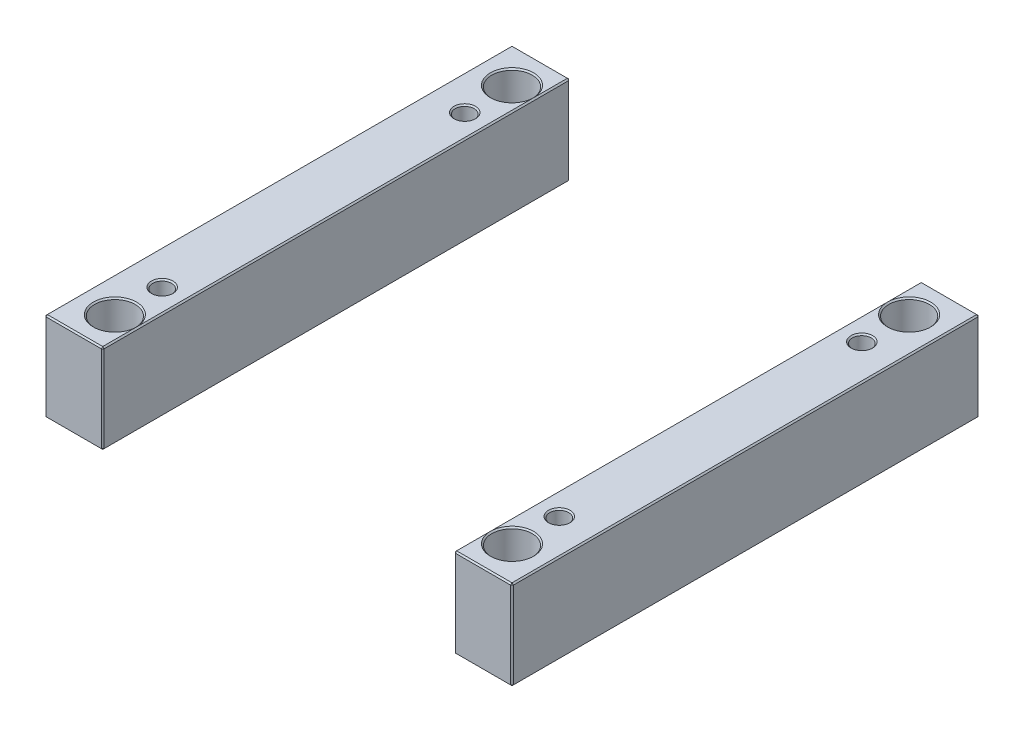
ISO-10303-21;
HEADER;
FILE_DESCRIPTION(('STEP AP214'),'2;1');
FILE_NAME('part.step','',(''),(''),'','','');
FILE_SCHEMA(('AUTOMOTIVE_DESIGN { 1 0 10303 214 1 1 1 1 }'));
ENDSEC;
DATA;
#1=APPLICATION_CONTEXT('core data for automotive mechanical design processes');
#2=APPLICATION_PROTOCOL_DEFINITION('international standard','automotive_design',2000,#1);
#3=PRODUCT_CONTEXT('',#1,'mechanical');
#4=PRODUCT('Part','Part','',(#3));
#5=PRODUCT_RELATED_PRODUCT_CATEGORY('part','',(#4));
#6=PRODUCT_DEFINITION_FORMATION('','',#4);
#7=PRODUCT_DEFINITION_CONTEXT('part definition',#1,'design');
#8=PRODUCT_DEFINITION('design','',#6,#7);
#9=PRODUCT_DEFINITION_SHAPE('','',#8);
#10=(LENGTH_UNIT() NAMED_UNIT(*) SI_UNIT(.MILLI.,.METRE.));
#11=(NAMED_UNIT(*) PLANE_ANGLE_UNIT() SI_UNIT($,.RADIAN.));
#12=(NAMED_UNIT(*) SI_UNIT($,.STERADIAN.) SOLID_ANGLE_UNIT());
#13=UNCERTAINTY_MEASURE_WITH_UNIT(LENGTH_MEASURE(1.E-05),#10,'distance_accuracy_value','');
#14=(GEOMETRIC_REPRESENTATION_CONTEXT(3) GLOBAL_UNCERTAINTY_ASSIGNED_CONTEXT((#13)) GLOBAL_UNIT_ASSIGNED_CONTEXT((#10,
#11,#12)) REPRESENTATION_CONTEXT('',''));
#15=CARTESIAN_POINT('',(0.,0.,0.));
#16=DIRECTION('',(0.,0.,1.));
#17=DIRECTION('',(1.,0.,0.));
#18=AXIS2_PLACEMENT_3D('',#15,#16,#17);
#19=CARTESIAN_POINT('',(-173.,66.,-173.));
#20=DIRECTION('',(0.,0.,1.));
#21=DIRECTION('',(1.,0.,0.));
#22=AXIS2_PLACEMENT_3D('',#19,#20,#21);
#23=PLANE('',#22);
#24=DIRECTION('',(-1.,0.,0.));
#25=VECTOR('',#24,1.);
#26=CARTESIAN_POINT('',(-173.,1.00000000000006,-173.));
#27=LINE('',#26,#25);
#28=CARTESIAN_POINT('',(-131.,1.00000000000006,-173.));
#29=VERTEX_POINT('',#28);
#30=CARTESIAN_POINT('',(-172.,1.00000000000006,-173.));
#31=VERTEX_POINT('',#30);
#32=EDGE_CURVE('P0_E151',#29,#31,#27,.T.);
#33=ORIENTED_EDGE('',*,*,#32,.T.);
#34=DIRECTION('',(0.,1.,0.));
#35=VECTOR('',#34,1.);
#36=CARTESIAN_POINT('',(-172.,66.,-173.));
#37=LINE('',#36,#35);
#38=CARTESIAN_POINT('',(-172.,65.,-173.));
#39=VERTEX_POINT('',#38);
#40=EDGE_CURVE('P0_E266',#31,#39,#37,.T.);
#41=ORIENTED_EDGE('',*,*,#40,.T.);
#42=DIRECTION('',(1.,0.,0.));
#43=VECTOR('',#42,1.);
#44=CARTESIAN_POINT('',(-173.,65.,-173.));
#45=LINE('',#44,#43);
#46=CARTESIAN_POINT('',(-131.,65.,-173.));
#47=VERTEX_POINT('',#46);
#48=EDGE_CURVE('P0_E264',#39,#47,#45,.T.);
#49=ORIENTED_EDGE('',*,*,#48,.T.);
#50=DIRECTION('',(0.,-1.,0.));
#51=VECTOR('',#50,1.);
#52=CARTESIAN_POINT('',(-131.,66.,-173.));
#53=LINE('',#52,#51);
#54=EDGE_CURVE('P0_E261',#47,#29,#53,.T.);
#55=ORIENTED_EDGE('',*,*,#54,.T.);
#56=EDGE_LOOP('',(#33,#41,#49,#55));
#57=FACE_BOUND('',#56,.T.);
#58=ADVANCED_FACE('P0_F16',(#57),#23,.F.);
#59=CARTESIAN_POINT('',(-173.,66.,173.));
#60=DIRECTION('',(1.,0.,0.));
#61=DIRECTION('',(0.,0.,-1.));
#62=AXIS2_PLACEMENT_3D('',#59,#60,#61);
#63=PLANE('',#62);
#64=DIRECTION('',(0.,1.,0.));
#65=VECTOR('',#64,1.);
#66=CARTESIAN_POINT('',(-173.,66.,172.));
#67=LINE('',#66,#65);
#68=CARTESIAN_POINT('',(-173.,1.00000000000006,172.));
#69=VERTEX_POINT('',#68);
#70=CARTESIAN_POINT('',(-173.,65.,172.));
#71=VERTEX_POINT('',#70);
#72=EDGE_CURVE('P0_E254',#69,#71,#67,.T.);
#73=ORIENTED_EDGE('',*,*,#72,.T.);
#74=DIRECTION('',(0.,0.,-1.));
#75=VECTOR('',#74,1.);
#76=CARTESIAN_POINT('',(-173.,65.,173.));
#77=LINE('',#76,#75);
#78=CARTESIAN_POINT('',(-173.,65.,-172.));
#79=VERTEX_POINT('',#78);
#80=EDGE_CURVE('P0_E259',#71,#79,#77,.T.);
#81=ORIENTED_EDGE('',*,*,#80,.T.);
#82=DIRECTION('',(0.,-1.,0.));
#83=VECTOR('',#82,1.);
#84=CARTESIAN_POINT('',(-173.,66.,-172.));
#85=LINE('',#84,#83);
#86=CARTESIAN_POINT('',(-173.,1.00000000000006,-172.));
#87=VERTEX_POINT('',#86);
#88=EDGE_CURVE('P0_E256',#79,#87,#85,.T.);
#89=ORIENTED_EDGE('',*,*,#88,.T.);
#90=DIRECTION('',(0.,0.,1.));
#91=VECTOR('',#90,1.);
#92=CARTESIAN_POINT('',(-173.,1.00000000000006,173.));
#93=LINE('',#92,#91);
#94=EDGE_CURVE('P0_E252',#87,#69,#93,.T.);
#95=ORIENTED_EDGE('',*,*,#94,.T.);
#96=EDGE_LOOP('',(#73,#81,#89,#95));
#97=FACE_BOUND('',#96,.T.);
#98=ADVANCED_FACE('P0_F340',(#97),#63,.F.);
#99=CARTESIAN_POINT('',(-173.,66.,173.));
#100=DIRECTION('',(0.,0.,-1.));
#101=DIRECTION('',(-1.,0.,0.));
#102=AXIS2_PLACEMENT_3D('',#99,#100,#101);
#103=PLANE('',#102);
#104=DIRECTION('',(-1.,0.,0.));
#105=VECTOR('',#104,1.);
#106=CARTESIAN_POINT('',(-173.,65.,173.));
#107=LINE('',#106,#105);
#108=CARTESIAN_POINT('',(-131.,65.,173.));
#109=VERTEX_POINT('',#108);
#110=CARTESIAN_POINT('',(-172.,65.,173.));
#111=VERTEX_POINT('',#110);
#112=EDGE_CURVE('P0_E273',#109,#111,#107,.T.);
#113=ORIENTED_EDGE('',*,*,#112,.T.);
#114=DIRECTION('',(0.,-1.,0.));
#115=VECTOR('',#114,1.);
#116=CARTESIAN_POINT('',(-172.,66.,173.));
#117=LINE('',#116,#115);
#118=CARTESIAN_POINT('',(-172.,1.00000000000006,173.));
#119=VERTEX_POINT('',#118);
#120=EDGE_CURVE('P0_E275',#111,#119,#117,.T.);
#121=ORIENTED_EDGE('',*,*,#120,.T.);
#122=DIRECTION('',(1.,0.,0.));
#123=VECTOR('',#122,1.);
#124=CARTESIAN_POINT('',(-130.,1.00000000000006,173.));
#125=LINE('',#124,#123);
#126=CARTESIAN_POINT('',(-131.,1.00000000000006,173.));
#127=VERTEX_POINT('',#126);
#128=EDGE_CURVE('P0_E271',#119,#127,#125,.T.);
#129=ORIENTED_EDGE('',*,*,#128,.T.);
#130=DIRECTION('',(0.,1.,0.));
#131=VECTOR('',#130,1.);
#132=CARTESIAN_POINT('',(-131.,66.,173.));
#133=LINE('',#132,#131);
#134=EDGE_CURVE('P0_E269',#127,#109,#133,.T.);
#135=ORIENTED_EDGE('',*,*,#134,.T.);
#136=EDGE_LOOP('',(#113,#121,#129,#135));
#137=FACE_BOUND('',#136,.T.);
#138=ADVANCED_FACE('P0_F395',(#137),#103,.F.);
#139=CARTESIAN_POINT('',(-130.,66.,-173.));
#140=DIRECTION('',(-1.,0.,0.));
#141=DIRECTION('',(0.,0.,1.));
#142=AXIS2_PLACEMENT_3D('',#139,#140,#141);
#143=PLANE('',#142);
#144=DIRECTION('',(0.,0.,1.));
#145=VECTOR('',#144,1.);
#146=CARTESIAN_POINT('',(-130.,65.,-173.));
#147=LINE('',#146,#145);
#148=CARTESIAN_POINT('',(-130.,65.,-172.));
#149=VERTEX_POINT('',#148);
#150=CARTESIAN_POINT('',(-130.,65.,172.));
#151=VERTEX_POINT('',#150);
#152=EDGE_CURVE('P0_E294',#149,#151,#147,.T.);
#153=ORIENTED_EDGE('',*,*,#152,.T.);
#154=DIRECTION('',(0.,-1.,0.));
#155=VECTOR('',#154,1.);
#156=CARTESIAN_POINT('',(-130.,66.,172.));
#157=LINE('',#156,#155);
#158=CARTESIAN_POINT('',(-130.,1.00000000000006,172.));
#159=VERTEX_POINT('',#158);
#160=EDGE_CURVE('P0_E206',#151,#159,#157,.T.);
#161=ORIENTED_EDGE('',*,*,#160,.T.);
#162=DIRECTION('',(0.,0.,-1.));
#163=VECTOR('',#162,1.);
#164=CARTESIAN_POINT('',(-130.,1.00000000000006,-173.));
#165=LINE('',#164,#163);
#166=CARTESIAN_POINT('',(-130.,1.00000000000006,-172.));
#167=VERTEX_POINT('',#166);
#168=EDGE_CURVE('P0_E290',#159,#167,#165,.T.);
#169=ORIENTED_EDGE('',*,*,#168,.T.);
#170=DIRECTION('',(0.,1.,0.));
#171=VECTOR('',#170,1.);
#172=CARTESIAN_POINT('',(-130.,66.,-172.));
#173=LINE('',#172,#171);
#174=EDGE_CURVE('P0_E292',#167,#149,#173,.T.);
#175=ORIENTED_EDGE('',*,*,#174,.T.);
#176=EDGE_LOOP('',(#153,#161,#169,#175));
#177=FACE_BOUND('',#176,.T.);
#178=ADVANCED_FACE('P0_F370',(#177),#143,.F.);
#179=CARTESIAN_POINT('',(0.,66.,0.));
#180=DIRECTION('',(0.,-1.,0.));
#181=DIRECTION('',(0.,0.,-1.));
#182=AXIS2_PLACEMENT_3D('',#179,#180,#181);
#183=PLANE('',#182);
#184=CARTESIAN_POINT('',(-147.,66.,112.));
#185=DIRECTION('',(0.,-1.,0.));
#186=DIRECTION('',(0.,0.,-1.));
#187=AXIS2_PLACEMENT_3D('',#184,#185,#186);
#188=CIRCLE('',#187,8.);
#189=CARTESIAN_POINT('',(-147.,66.,104.));
#190=VERTEX_POINT('',#189);
#191=EDGE_CURVE('P0_E209',#190,#190,#188,.T.);
#192=ORIENTED_EDGE('',*,*,#191,.T.);
#193=EDGE_LOOP('',(#192));
#194=FACE_BOUND('',#193,.T.);
#195=CARTESIAN_POINT('',(-147.,66.,-112.));
#196=DIRECTION('',(0.,-1.,0.));
#197=DIRECTION('',(0.,0.,-1.));
#198=AXIS2_PLACEMENT_3D('',#195,#196,#197);
#199=CIRCLE('',#198,8.);
#200=CARTESIAN_POINT('',(-147.,66.,-120.));
#201=VERTEX_POINT('',#200);
#202=EDGE_CURVE('P0_E205',#201,#201,#199,.T.);
#203=ORIENTED_EDGE('',*,*,#202,.T.);
#204=EDGE_LOOP('',(#203));
#205=FACE_BOUND('',#204,.T.);
#206=DIRECTION('',(0.,0.,-1.));
#207=VECTOR('',#206,1.);
#208=CARTESIAN_POINT('',(-131.,66.,0.));
#209=LINE('',#208,#207);
#210=CARTESIAN_POINT('',(-131.,66.,147.));
#211=VERTEX_POINT('',#210);
#212=CARTESIAN_POINT('',(-131.,66.,-147.));
#213=VERTEX_POINT('',#212);
#214=EDGE_CURVE('P0_E283',#211,#213,#209,.T.);
#215=ORIENTED_EDGE('',*,*,#214,.T.);
#216=CARTESIAN_POINT('',(-147.,66.,-147.));
#217=DIRECTION('',(0.,-1.,0.));
#218=DIRECTION('',(0.,0.,-1.));
#219=AXIS2_PLACEMENT_3D('',#216,#217,#218);
#220=CIRCLE('',#219,16.);
#221=EDGE_CURVE('P0_E29',#213,#213,#220,.T.);
#222=ORIENTED_EDGE('',*,*,#221,.T.);
#223=CARTESIAN_POINT('',(-131.,66.,-172.));
#224=VERTEX_POINT('',#223);
#225=EDGE_CURVE('P0_E278',#213,#224,#209,.T.);
#226=ORIENTED_EDGE('',*,*,#225,.T.);
#227=DIRECTION('',(-1.,0.,0.));
#228=VECTOR('',#227,1.);
#229=CARTESIAN_POINT('',(-1.11022302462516E-13,66.,-172.));
#230=LINE('',#229,#228);
#231=CARTESIAN_POINT('',(-172.,66.,-172.));
#232=VERTEX_POINT('',#231);
#233=EDGE_CURVE('P0_E282',#224,#232,#230,.T.);
#234=ORIENTED_EDGE('',*,*,#233,.T.);
#235=DIRECTION('',(0.,0.,1.));
#236=VECTOR('',#235,1.);
#237=CARTESIAN_POINT('',(-172.,66.,0.));
#238=LINE('',#237,#236);
#239=CARTESIAN_POINT('',(-172.,66.,172.));
#240=VERTEX_POINT('',#239);
#241=EDGE_CURVE('P0_E285',#232,#240,#238,.T.);
#242=ORIENTED_EDGE('',*,*,#241,.T.);
#243=DIRECTION('',(1.,0.,0.));
#244=VECTOR('',#243,1.);
#245=CARTESIAN_POINT('',(1.11022302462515E-13,66.,172.));
#246=LINE('',#245,#244);
#247=CARTESIAN_POINT('',(-131.,66.,172.));
#248=VERTEX_POINT('',#247);
#249=EDGE_CURVE('P0_E287',#240,#248,#246,.T.);
#250=ORIENTED_EDGE('',*,*,#249,.T.);
#251=EDGE_CURVE('P0_E279',#248,#211,#209,.T.);
#252=ORIENTED_EDGE('',*,*,#251,.T.);
#253=CARTESIAN_POINT('',(-147.,66.,147.));
#254=DIRECTION('',(0.,-1.,0.));
#255=DIRECTION('',(0.,0.,-1.));
#256=AXIS2_PLACEMENT_3D('',#253,#254,#255);
#257=CIRCLE('',#256,16.);
#258=EDGE_CURVE('P0_E34',#211,#211,#257,.T.);
#259=ORIENTED_EDGE('',*,*,#258,.T.);
#260=EDGE_LOOP('',(#215,#222,#226,#234,#242,#250,#252,#259));
#261=FACE_BOUND('',#260,.T.);
#262=ADVANCED_FACE('P0_F354',(#194,#205,#261),#183,.F.);
#263=CARTESIAN_POINT('',(0.,0.,0.));
#264=DIRECTION('',(0.,-1.,0.));
#265=DIRECTION('',(0.,0.,-1.));
#266=AXIS2_PLACEMENT_3D('',#263,#264,#265);
#267=PLANE('',#266);
#268=CARTESIAN_POINT('',(-147.,0.,-112.));
#269=DIRECTION('',(0.,-1.,0.));
#270=DIRECTION('',(0.,0.,-1.));
#271=AXIS2_PLACEMENT_3D('',#268,#269,#270);
#272=CIRCLE('',#271,8.);
#273=CARTESIAN_POINT('',(-147.,0.,-120.));
#274=VERTEX_POINT('',#273);
#275=EDGE_CURVE('P0_E243',#274,#274,#272,.F.);
#276=ORIENTED_EDGE('',*,*,#275,.T.);
#277=EDGE_LOOP('',(#276));
#278=FACE_BOUND('',#277,.T.);
#279=CARTESIAN_POINT('',(-147.,0.,112.));
#280=DIRECTION('',(0.,-1.,0.));
#281=DIRECTION('',(0.,0.,-1.));
#282=AXIS2_PLACEMENT_3D('',#279,#280,#281);
#283=CIRCLE('',#282,8.);
#284=CARTESIAN_POINT('',(-147.,0.,104.));
#285=VERTEX_POINT('',#284);
#286=EDGE_CURVE('P0_E240',#285,#285,#283,.F.);
#287=ORIENTED_EDGE('',*,*,#286,.T.);
#288=EDGE_LOOP('',(#287));
#289=FACE_BOUND('',#288,.T.);
#290=DIRECTION('',(0.,0.,1.));
#291=VECTOR('',#290,1.);
#292=CARTESIAN_POINT('',(-131.,0.,173.));
#293=LINE('',#292,#291);
#294=CARTESIAN_POINT('',(-131.,0.,-172.));
#295=VERTEX_POINT('',#294);
#296=CARTESIAN_POINT('',(-131.,0.,-147.));
#297=VERTEX_POINT('',#296);
#298=EDGE_CURVE('P0_E120',#295,#297,#293,.T.);
#299=ORIENTED_EDGE('',*,*,#298,.T.);
#300=CARTESIAN_POINT('',(-147.,0.,-147.));
#301=DIRECTION('',(0.,-1.,0.));
#302=DIRECTION('',(0.,0.,-1.));
#303=AXIS2_PLACEMENT_3D('',#300,#301,#302);
#304=CIRCLE('',#303,16.);
#305=EDGE_CURVE('P0_E218',#297,#297,#304,.F.);
#306=ORIENTED_EDGE('',*,*,#305,.T.);
#307=CARTESIAN_POINT('',(-131.,0.,147.));
#308=VERTEX_POINT('',#307);
#309=EDGE_CURVE('P0_E138',#297,#308,#293,.T.);
#310=ORIENTED_EDGE('',*,*,#309,.T.);
#311=CARTESIAN_POINT('',(-147.,0.,147.));
#312=DIRECTION('',(0.,-1.,0.));
#313=DIRECTION('',(0.,0.,-1.));
#314=AXIS2_PLACEMENT_3D('',#311,#312,#313);
#315=CIRCLE('',#314,16.);
#316=EDGE_CURVE('P0_E215',#308,#308,#315,.F.);
#317=ORIENTED_EDGE('',*,*,#316,.T.);
#318=CARTESIAN_POINT('',(-131.,0.,172.));
#319=VERTEX_POINT('',#318);
#320=EDGE_CURVE('P0_E140',#308,#319,#293,.T.);
#321=ORIENTED_EDGE('',*,*,#320,.T.);
#322=DIRECTION('',(-1.,0.,0.));
#323=VECTOR('',#322,1.);
#324=CARTESIAN_POINT('',(-173.,0.,172.));
#325=LINE('',#324,#323);
#326=CARTESIAN_POINT('',(-172.,0.,172.));
#327=VERTEX_POINT('',#326);
#328=EDGE_CURVE('P0_E126',#319,#327,#325,.T.);
#329=ORIENTED_EDGE('',*,*,#328,.T.);
#330=DIRECTION('',(0.,0.,-1.));
#331=VECTOR('',#330,1.);
#332=CARTESIAN_POINT('',(-172.,0.,-173.));
#333=LINE('',#332,#331);
#334=CARTESIAN_POINT('',(-172.,0.,-172.));
#335=VERTEX_POINT('',#334);
#336=EDGE_CURVE('P0_E122',#327,#335,#333,.T.);
#337=ORIENTED_EDGE('',*,*,#336,.T.);
#338=DIRECTION('',(1.,0.,0.));
#339=VECTOR('',#338,1.);
#340=CARTESIAN_POINT('',(-130.,0.,-172.));
#341=LINE('',#340,#339);
#342=EDGE_CURVE('P0_E116',#335,#295,#341,.T.);
#343=ORIENTED_EDGE('',*,*,#342,.T.);
#344=EDGE_LOOP('',(#299,#306,#310,#317,#321,#329,#337,#343));
#345=FACE_BOUND('',#344,.T.);
#346=ADVANCED_FACE('P0_F118',(#278,#289,#345),#267,.T.);
#347=CARTESIAN_POINT('',(-147.,0.,-112.));
#348=DIRECTION('',(0.,1.,0.));
#349=DIRECTION('',(0.,0.,1.));
#350=AXIS2_PLACEMENT_3D('',#347,#348,#349);
#351=CYLINDRICAL_SURFACE('',#350,7.);
#352=CARTESIAN_POINT('',(-147.,65.,-112.));
#353=DIRECTION('',(0.,-1.,0.));
#354=DIRECTION('',(0.,0.,-1.));
#355=AXIS2_PLACEMENT_3D('',#352,#353,#354);
#356=CIRCLE('',#355,7.);
#357=CARTESIAN_POINT('',(-147.,65.,-119.));
#358=VERTEX_POINT('',#357);
#359=EDGE_CURVE('P0_E212',#358,#358,#356,.F.);
#360=ORIENTED_EDGE('',*,*,#359,.T.);
#361=EDGE_LOOP('',(#360));
#362=FACE_BOUND('',#361,.T.);
#363=CARTESIAN_POINT('',(-147.,0.999999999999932,-112.));
#364=DIRECTION('',(0.,-1.,0.));
#365=DIRECTION('',(0.,0.,-1.));
#366=AXIS2_PLACEMENT_3D('',#363,#364,#365);
#367=CIRCLE('',#366,7.);
#368=CARTESIAN_POINT('',(-147.,0.999999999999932,-119.));
#369=VERTEX_POINT('',#368);
#370=EDGE_CURVE('P0_E246',#369,#369,#367,.T.);
#371=ORIENTED_EDGE('',*,*,#370,.T.);
#372=EDGE_LOOP('',(#371));
#373=FACE_BOUND('',#372,.T.);
#374=ADVANCED_FACE('P0_F445',(#362,#373),#351,.F.);
#375=CARTESIAN_POINT('',(-147.,0.,112.));
#376=DIRECTION('',(0.,1.,0.));
#377=DIRECTION('',(0.,0.,1.));
#378=AXIS2_PLACEMENT_3D('',#375,#376,#377);
#379=CYLINDRICAL_SURFACE('',#378,7.);
#380=CARTESIAN_POINT('',(-147.,65.,112.));
#381=DIRECTION('',(0.,-1.,0.));
#382=DIRECTION('',(0.,0.,-1.));
#383=AXIS2_PLACEMENT_3D('',#380,#381,#382);
#384=CIRCLE('',#383,7.);
#385=CARTESIAN_POINT('',(-147.,65.,105.));
#386=VERTEX_POINT('',#385);
#387=EDGE_CURVE('P0_E202',#386,#386,#384,.F.);
#388=ORIENTED_EDGE('',*,*,#387,.T.);
#389=EDGE_LOOP('',(#388));
#390=FACE_BOUND('',#389,.T.);
#391=CARTESIAN_POINT('',(-147.,0.999999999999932,112.));
#392=DIRECTION('',(0.,-1.,0.));
#393=DIRECTION('',(0.,0.,-1.));
#394=AXIS2_PLACEMENT_3D('',#391,#392,#393);
#395=CIRCLE('',#394,7.);
#396=CARTESIAN_POINT('',(-147.,0.999999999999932,105.));
#397=VERTEX_POINT('',#396);
#398=EDGE_CURVE('P0_E249',#397,#397,#395,.T.);
#399=ORIENTED_EDGE('',*,*,#398,.T.);
#400=EDGE_LOOP('',(#399));
#401=FACE_BOUND('',#400,.T.);
#402=ADVANCED_FACE('P0_F403',(#390,#401),#379,.F.);
#403=CARTESIAN_POINT('',(-147.,0.,-112.));
#404=DIRECTION('',(0.,-1.,0.));
#405=DIRECTION('',(0.,0.,-1.));
#406=AXIS2_PLACEMENT_3D('',#403,#404,#405);
#407=CONICAL_SURFACE('',#406,8.,0.785398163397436);
#408=ORIENTED_EDGE('',*,*,#370,.F.);
#409=EDGE_LOOP('',(#408));
#410=FACE_BOUND('',#409,.T.);
#411=ORIENTED_EDGE('',*,*,#275,.F.);
#412=EDGE_LOOP('',(#411));
#413=FACE_BOUND('',#412,.T.);
#414=ADVANCED_FACE('P0_F399',(#410,#413),#407,.F.);
#415=CARTESIAN_POINT('',(-147.,0.,112.));
#416=DIRECTION('',(0.,-1.,0.));
#417=DIRECTION('',(0.,0.,-1.));
#418=AXIS2_PLACEMENT_3D('',#415,#416,#417);
#419=CONICAL_SURFACE('',#418,8.,0.785398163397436);
#420=ORIENTED_EDGE('',*,*,#398,.F.);
#421=EDGE_LOOP('',(#420));
#422=FACE_BOUND('',#421,.T.);
#423=ORIENTED_EDGE('',*,*,#286,.F.);
#424=EDGE_LOOP('',(#423));
#425=FACE_BOUND('',#424,.T.);
#426=ADVANCED_FACE('P0_F402',(#422,#425),#419,.F.);
#427=CARTESIAN_POINT('',(-130.,66.,172.));
#428=DIRECTION('',(-0.707106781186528,0.,-0.707106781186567));
#429=DIRECTION('',(0.,-1.,0.));
#430=AXIS2_PLACEMENT_3D('',#427,#428,#429);
#431=PLANE('',#430);
#432=DIRECTION('',(-0.707106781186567,0.,0.707106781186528));
#433=VECTOR('',#432,1.);
#434=CARTESIAN_POINT('',(-130.5,65.,172.5));
#435=LINE('',#434,#433);
#436=EDGE_CURVE('P0_E199',#109,#151,#435,.F.);
#437=ORIENTED_EDGE('',*,*,#436,.F.);
#438=ORIENTED_EDGE('',*,*,#134,.F.);
#439=DIRECTION('',(0.707106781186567,0.,-0.707106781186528));
#440=VECTOR('',#439,1.);
#441=CARTESIAN_POINT('',(-131.,1.00000000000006,173.));
#442=LINE('',#441,#440);
#443=EDGE_CURVE('P0_E196',#159,#127,#442,.F.);
#444=ORIENTED_EDGE('',*,*,#443,.F.);
#445=ORIENTED_EDGE('',*,*,#160,.F.);
#446=EDGE_LOOP('',(#437,#438,#444,#445));
#447=FACE_BOUND('',#446,.T.);
#448=ADVANCED_FACE('P0_F367',(#447),#431,.F.);
#449=CARTESIAN_POINT('',(-131.,66.,172.));
#450=DIRECTION('',(0.577350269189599,0.577350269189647,0.577350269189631));
#451=DIRECTION('',(0.,-0.707106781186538,0.707106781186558));
#452=AXIS2_PLACEMENT_3D('',#449,#450,#451);
#453=PLANE('',#452);
#454=DIRECTION('',(0.,0.707106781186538,-0.707106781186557));
#455=VECTOR('',#454,1.);
#456=CARTESIAN_POINT('',(-131.,66.,172.));
#457=LINE('',#456,#455);
#458=EDGE_CURVE('P0_E190',#109,#248,#457,.T.);
#459=ORIENTED_EDGE('',*,*,#458,.F.);
#460=ORIENTED_EDGE('',*,*,#436,.T.);
#461=DIRECTION('',(0.707106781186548,-0.707106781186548,0.));
#462=VECTOR('',#461,1.);
#463=CARTESIAN_POINT('',(-131.,66.,172.));
#464=LINE('',#463,#462);
#465=EDGE_CURVE('P0_E193',#248,#151,#464,.T.);
#466=ORIENTED_EDGE('',*,*,#465,.F.);
#467=EDGE_LOOP('',(#459,#460,#466));
#468=FACE_BOUND('',#467,.T.);
#469=ADVANCED_FACE('P0_F362',(#468),#453,.T.);
#470=CARTESIAN_POINT('',(-131.,1.00000000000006,173.));
#471=DIRECTION('',(0.577350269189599,-0.577350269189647,0.577350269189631));
#472=DIRECTION('',(0.,-0.707106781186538,-0.707106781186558));
#473=AXIS2_PLACEMENT_3D('',#470,#471,#472);
#474=PLANE('',#473);
#475=DIRECTION('',(0.707106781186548,0.707106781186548,0.));
#476=VECTOR('',#475,1.);
#477=CARTESIAN_POINT('',(-130.5,0.50000000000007,172.));
#478=LINE('',#477,#476);
#479=EDGE_CURVE('P0_E185',#159,#319,#478,.F.);
#480=ORIENTED_EDGE('',*,*,#479,.F.);
#481=ORIENTED_EDGE('',*,*,#443,.T.);
#482=DIRECTION('',(0.,-0.707106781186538,-0.707106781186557));
#483=VECTOR('',#482,1.);
#484=CARTESIAN_POINT('',(-131.,1.00000000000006,173.));
#485=LINE('',#484,#483);
#486=EDGE_CURVE('P0_E187',#319,#127,#485,.F.);
#487=ORIENTED_EDGE('',*,*,#486,.F.);
#488=EDGE_LOOP('',(#480,#481,#487));
#489=FACE_BOUND('',#488,.T.);
#490=ADVANCED_FACE('P0_F492',(#489),#474,.T.);
#491=CARTESIAN_POINT('',(-131.,66.,0.));
#492=DIRECTION('',(-0.707106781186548,-0.707106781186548,0.));
#493=DIRECTION('',(0.,0.,-1.));
#494=AXIS2_PLACEMENT_3D('',#491,#492,#493);
#495=PLANE('',#494);
#496=ORIENTED_EDGE('',*,*,#465,.T.);
#497=ORIENTED_EDGE('',*,*,#152,.F.);
#498=DIRECTION('',(-0.707106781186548,0.707106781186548,0.));
#499=VECTOR('',#498,1.);
#500=CARTESIAN_POINT('',(-130.5,65.5,-172.));
#501=LINE('',#500,#499);
#502=EDGE_CURVE('P0_E179',#224,#149,#501,.F.);
#503=ORIENTED_EDGE('',*,*,#502,.F.);
#504=ORIENTED_EDGE('',*,*,#225,.F.);
#505=ORIENTED_EDGE('',*,*,#214,.F.);
#506=ORIENTED_EDGE('',*,*,#251,.F.);
#507=EDGE_LOOP('',(#496,#497,#503,#504,#505,#506));
#508=FACE_BOUND('',#507,.T.);
#509=ADVANCED_FACE('P0_F358',(#508),#495,.F.);
#510=CARTESIAN_POINT('',(1.11022302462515E-13,66.,172.));
#511=DIRECTION('',(0.,-0.707106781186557,-0.707106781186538));
#512=DIRECTION('',(1.,0.,0.));
#513=AXIS2_PLACEMENT_3D('',#510,#511,#512);
#514=PLANE('',#513);
#515=ORIENTED_EDGE('',*,*,#458,.T.);
#516=ORIENTED_EDGE('',*,*,#249,.F.);
#517=DIRECTION('',(0.,-0.707106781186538,0.707106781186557));
#518=VECTOR('',#517,1.);
#519=CARTESIAN_POINT('',(-172.,65.5,172.5));
#520=LINE('',#519,#518);
#521=EDGE_CURVE('P0_E176',#111,#240,#520,.F.);
#522=ORIENTED_EDGE('',*,*,#521,.F.);
#523=ORIENTED_EDGE('',*,*,#112,.F.);
#524=EDGE_LOOP('',(#515,#516,#522,#523));
#525=FACE_BOUND('',#524,.T.);
#526=ADVANCED_FACE('P0_F351',(#525),#514,.F.);
#527=CARTESIAN_POINT('',(-172.,66.,173.));
#528=DIRECTION('',(0.707106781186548,0.,-0.707106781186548));
#529=DIRECTION('',(0.,-1.,0.));
#530=AXIS2_PLACEMENT_3D('',#527,#528,#529);
#531=PLANE('',#530);
#532=DIRECTION('',(0.707106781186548,0.,0.707106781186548));
#533=VECTOR('',#532,1.);
#534=CARTESIAN_POINT('',(-172.,1.00000000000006,173.));
#535=LINE('',#534,#533);
#536=EDGE_CURVE('P0_E170',#119,#69,#535,.F.);
#537=ORIENTED_EDGE('',*,*,#536,.F.);
#538=ORIENTED_EDGE('',*,*,#120,.F.);
#539=DIRECTION('',(-0.707106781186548,0.,-0.707106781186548));
#540=VECTOR('',#539,1.);
#541=CARTESIAN_POINT('',(-173.,65.,172.));
#542=LINE('',#541,#540);
#543=EDGE_CURVE('P0_E173',#71,#111,#542,.F.);
#544=ORIENTED_EDGE('',*,*,#543,.F.);
#545=ORIENTED_EDGE('',*,*,#72,.F.);
#546=EDGE_LOOP('',(#537,#538,#544,#545));
#547=FACE_BOUND('',#546,.T.);
#548=ADVANCED_FACE('P0_F345',(#547),#531,.F.);
#549=CARTESIAN_POINT('',(-173.,1.00000000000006,173.));
#550=DIRECTION('',(0.,-0.707106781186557,0.707106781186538));
#551=DIRECTION('',(-1.,0.,0.));
#552=AXIS2_PLACEMENT_3D('',#549,#550,#551);
#553=PLANE('',#552);
#554=ORIENTED_EDGE('',*,*,#486,.T.);
#555=ORIENTED_EDGE('',*,*,#128,.F.);
#556=DIRECTION('',(0.,0.707106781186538,0.707106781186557));
#557=VECTOR('',#556,1.);
#558=CARTESIAN_POINT('',(-172.,1.00000000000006,173.));
#559=LINE('',#558,#557);
#560=EDGE_CURVE('P0_E148',#327,#119,#559,.T.);
#561=ORIENTED_EDGE('',*,*,#560,.F.);
#562=ORIENTED_EDGE('',*,*,#328,.F.);
#563=EDGE_LOOP('',(#554,#555,#561,#562));
#564=FACE_BOUND('',#563,.T.);
#565=ADVANCED_FACE('P0_F434',(#564),#553,.T.);
#566=CARTESIAN_POINT('',(-130.,1.00000000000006,-173.));
#567=DIRECTION('',(0.707106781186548,-0.707106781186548,0.));
#568=DIRECTION('',(0.,0.,1.));
#569=AXIS2_PLACEMENT_3D('',#566,#567,#568);
#570=PLANE('',#569);
#571=ORIENTED_EDGE('',*,*,#479,.T.);
#572=ORIENTED_EDGE('',*,*,#320,.F.);
#573=ORIENTED_EDGE('',*,*,#309,.F.);
#574=ORIENTED_EDGE('',*,*,#298,.F.);
#575=DIRECTION('',(-0.707106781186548,-0.707106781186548,0.));
#576=VECTOR('',#575,1.);
#577=CARTESIAN_POINT('',(-131.,0.,-172.));
#578=LINE('',#577,#576);
#579=EDGE_CURVE('P0_E134',#167,#295,#578,.T.);
#580=ORIENTED_EDGE('',*,*,#579,.F.);
#581=ORIENTED_EDGE('',*,*,#168,.F.);
#582=EDGE_LOOP('',(#571,#572,#573,#574,#580,#581));
#583=FACE_BOUND('',#582,.T.);
#584=ADVANCED_FACE('P0_F133',(#583),#570,.T.);
#585=CARTESIAN_POINT('',(-131.,66.,-173.));
#586=DIRECTION('',(-0.707106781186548,0.,0.707106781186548));
#587=DIRECTION('',(0.,-1.,0.));
#588=AXIS2_PLACEMENT_3D('',#585,#586,#587);
#589=PLANE('',#588);
#590=DIRECTION('',(0.707106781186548,0.,0.707106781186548));
#591=VECTOR('',#590,1.);
#592=CARTESIAN_POINT('',(-131.,65.,-173.));
#593=LINE('',#592,#591);
#594=EDGE_CURVE('P0_E182',#149,#47,#593,.F.);
#595=ORIENTED_EDGE('',*,*,#594,.F.);
#596=ORIENTED_EDGE('',*,*,#174,.F.);
#597=DIRECTION('',(-0.707106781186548,0.,-0.707106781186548));
#598=VECTOR('',#597,1.);
#599=CARTESIAN_POINT('',(-130.5,1.00000000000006,-172.5));
#600=LINE('',#599,#598);
#601=EDGE_CURVE('P0_E147',#29,#167,#600,.F.);
#602=ORIENTED_EDGE('',*,*,#601,.F.);
#603=ORIENTED_EDGE('',*,*,#54,.F.);
#604=EDGE_LOOP('',(#595,#596,#602,#603));
#605=FACE_BOUND('',#604,.T.);
#606=ADVANCED_FACE('P0_F375',(#605),#589,.F.);
#607=CARTESIAN_POINT('',(-131.,65.,-173.));
#608=DIRECTION('',(0.57735026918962,0.577350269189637,-0.57735026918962));
#609=DIRECTION('',(0.,0.707106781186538,0.707106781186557));
#610=AXIS2_PLACEMENT_3D('',#607,#608,#609);
#611=PLANE('',#610);
#612=ORIENTED_EDGE('',*,*,#502,.T.);
#613=ORIENTED_EDGE('',*,*,#594,.T.);
#614=DIRECTION('',(0.,-0.707106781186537,-0.707106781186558));
#615=VECTOR('',#614,1.);
#616=CARTESIAN_POINT('',(-131.,65.,-173.));
#617=LINE('',#616,#615);
#618=EDGE_CURVE('P0_E165',#224,#47,#617,.T.);
#619=ORIENTED_EDGE('',*,*,#618,.F.);
#620=EDGE_LOOP('',(#612,#613,#619));
#621=FACE_BOUND('',#620,.T.);
#622=ADVANCED_FACE('P0_F377',(#621),#611,.T.);
#623=CARTESIAN_POINT('',(-173.,65.,172.));
#624=DIRECTION('',(-0.57735026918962,0.577350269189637,0.57735026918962));
#625=DIRECTION('',(0.,-0.707106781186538,0.707106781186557));
#626=AXIS2_PLACEMENT_3D('',#623,#624,#625);
#627=PLANE('',#626);
#628=ORIENTED_EDGE('',*,*,#543,.T.);
#629=ORIENTED_EDGE('',*,*,#521,.T.);
#630=DIRECTION('',(0.707106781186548,0.707106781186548,0.));
#631=VECTOR('',#630,1.);
#632=CARTESIAN_POINT('',(-173.,65.,172.));
#633=LINE('',#632,#631);
#634=EDGE_CURVE('P0_E156',#71,#240,#633,.T.);
#635=ORIENTED_EDGE('',*,*,#634,.F.);
#636=EDGE_LOOP('',(#628,#629,#635));
#637=FACE_BOUND('',#636,.T.);
#638=ADVANCED_FACE('P0_F348',(#637),#627,.T.);
#639=CARTESIAN_POINT('',(-172.,1.00000000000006,173.));
#640=DIRECTION('',(-0.57735026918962,-0.577350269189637,0.57735026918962));
#641=DIRECTION('',(0.,-0.707106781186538,-0.707106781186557));
#642=AXIS2_PLACEMENT_3D('',#639,#640,#641);
#643=PLANE('',#642);
#644=ORIENTED_EDGE('',*,*,#560,.T.);
#645=ORIENTED_EDGE('',*,*,#536,.T.);
#646=DIRECTION('',(0.707106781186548,-0.707106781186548,0.));
#647=VECTOR('',#646,1.);
#648=CARTESIAN_POINT('',(-172.5,0.500000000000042,172.));
#649=LINE('',#648,#647);
#650=EDGE_CURVE('P0_E152',#327,#69,#649,.F.);
#651=ORIENTED_EDGE('',*,*,#650,.F.);
#652=EDGE_LOOP('',(#644,#645,#651));
#653=FACE_BOUND('',#652,.T.);
#654=ADVANCED_FACE('P0_F386',(#653),#643,.T.);
#655=CARTESIAN_POINT('',(-131.,0.,-172.));
#656=DIRECTION('',(0.57735026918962,-0.577350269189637,-0.57735026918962));
#657=DIRECTION('',(0.,0.707106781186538,-0.707106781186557));
#658=AXIS2_PLACEMENT_3D('',#655,#656,#657);
#659=PLANE('',#658);
#660=ORIENTED_EDGE('',*,*,#601,.T.);
#661=ORIENTED_EDGE('',*,*,#579,.T.);
#662=DIRECTION('',(0.,0.707106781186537,-0.707106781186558));
#663=VECTOR('',#662,1.);
#664=CARTESIAN_POINT('',(-131.,0.,-172.));
#665=LINE('',#664,#663);
#666=EDGE_CURVE('P0_E144',#29,#295,#665,.F.);
#667=ORIENTED_EDGE('',*,*,#666,.F.);
#668=EDGE_LOOP('',(#660,#661,#667));
#669=FACE_BOUND('',#668,.T.);
#670=ADVANCED_FACE('P0_F143',(#669),#659,.T.);
#671=CARTESIAN_POINT('',(-1.11022302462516E-13,66.,-172.));
#672=DIRECTION('',(0.,-0.707106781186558,0.707106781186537));
#673=DIRECTION('',(-1.,0.,0.));
#674=AXIS2_PLACEMENT_3D('',#671,#672,#673);
#675=PLANE('',#674);
#676=ORIENTED_EDGE('',*,*,#618,.T.);
#677=ORIENTED_EDGE('',*,*,#48,.F.);
#678=DIRECTION('',(0.,0.707106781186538,0.707106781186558));
#679=VECTOR('',#678,1.);
#680=CARTESIAN_POINT('',(-172.,65.,-173.));
#681=LINE('',#680,#679);
#682=EDGE_CURVE('P0_E153',#232,#39,#681,.F.);
#683=ORIENTED_EDGE('',*,*,#682,.F.);
#684=ORIENTED_EDGE('',*,*,#233,.F.);
#685=EDGE_LOOP('',(#676,#677,#683,#684));
#686=FACE_BOUND('',#685,.T.);
#687=ADVANCED_FACE('P0_F323',(#686),#675,.F.);
#688=CARTESIAN_POINT('',(-172.,66.,0.));
#689=DIRECTION('',(0.707106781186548,-0.707106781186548,0.));
#690=DIRECTION('',(0.,0.,1.));
#691=AXIS2_PLACEMENT_3D('',#688,#689,#690);
#692=PLANE('',#691);
#693=ORIENTED_EDGE('',*,*,#634,.T.);
#694=ORIENTED_EDGE('',*,*,#241,.F.);
#695=DIRECTION('',(-0.707106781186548,-0.707106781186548,0.));
#696=VECTOR('',#695,1.);
#697=CARTESIAN_POINT('',(-172.5,65.5,-172.));
#698=LINE('',#697,#696);
#699=EDGE_CURVE('P0_E159',#79,#232,#698,.F.);
#700=ORIENTED_EDGE('',*,*,#699,.F.);
#701=ORIENTED_EDGE('',*,*,#80,.F.);
#702=EDGE_LOOP('',(#693,#694,#700,#701));
#703=FACE_BOUND('',#702,.T.);
#704=ADVANCED_FACE('P0_F317',(#703),#692,.F.);
#705=CARTESIAN_POINT('',(-173.,1.00000000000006,173.));
#706=DIRECTION('',(-0.707106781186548,-0.707106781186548,0.));
#707=DIRECTION('',(0.,0.,-1.));
#708=AXIS2_PLACEMENT_3D('',#705,#706,#707);
#709=PLANE('',#708);
#710=ORIENTED_EDGE('',*,*,#650,.T.);
#711=ORIENTED_EDGE('',*,*,#94,.F.);
#712=DIRECTION('',(-0.707106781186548,0.707106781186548,0.));
#713=VECTOR('',#712,1.);
#714=CARTESIAN_POINT('',(-173.,1.00000000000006,-172.));
#715=LINE('',#714,#713);
#716=EDGE_CURVE('P0_E304',#335,#87,#715,.T.);
#717=ORIENTED_EDGE('',*,*,#716,.F.);
#718=ORIENTED_EDGE('',*,*,#336,.F.);
#719=EDGE_LOOP('',(#710,#711,#717,#718));
#720=FACE_BOUND('',#719,.T.);
#721=ADVANCED_FACE('P0_F336',(#720),#709,.T.);
#722=CARTESIAN_POINT('',(-173.,1.00000000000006,-173.));
#723=DIRECTION('',(0.,-0.707106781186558,-0.707106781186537));
#724=DIRECTION('',(1.,0.,0.));
#725=AXIS2_PLACEMENT_3D('',#722,#723,#724);
#726=PLANE('',#725);
#727=ORIENTED_EDGE('',*,*,#666,.T.);
#728=ORIENTED_EDGE('',*,*,#342,.F.);
#729=DIRECTION('',(0.,-0.707106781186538,0.707106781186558));
#730=VECTOR('',#729,1.);
#731=CARTESIAN_POINT('',(-172.,0.500000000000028,-172.5));
#732=LINE('',#731,#730);
#733=EDGE_CURVE('P0_E302',#31,#335,#732,.T.);
#734=ORIENTED_EDGE('',*,*,#733,.F.);
#735=ORIENTED_EDGE('',*,*,#32,.F.);
#736=EDGE_LOOP('',(#727,#728,#734,#735));
#737=FACE_BOUND('',#736,.T.);
#738=ADVANCED_FACE('P0_F150',(#737),#726,.T.);
#739=CARTESIAN_POINT('',(-172.,65.,-173.));
#740=DIRECTION('',(-0.57735026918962,0.577350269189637,-0.57735026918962));
#741=DIRECTION('',(0.,0.707106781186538,0.707106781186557));
#742=AXIS2_PLACEMENT_3D('',#739,#740,#741);
#743=PLANE('',#742);
#744=ORIENTED_EDGE('',*,*,#699,.T.);
#745=ORIENTED_EDGE('',*,*,#682,.T.);
#746=DIRECTION('',(0.707106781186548,0.,-0.707106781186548));
#747=VECTOR('',#746,1.);
#748=CARTESIAN_POINT('',(-172.,65.,-173.));
#749=LINE('',#748,#747);
#750=EDGE_CURVE('P0_E300',#79,#39,#749,.T.);
#751=ORIENTED_EDGE('',*,*,#750,.F.);
#752=EDGE_LOOP('',(#744,#745,#751));
#753=FACE_BOUND('',#752,.T.);
#754=ADVANCED_FACE('P0_F310',(#753),#743,.T.);
#755=CARTESIAN_POINT('',(-173.,1.00000000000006,-172.));
#756=DIRECTION('',(-0.57735026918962,-0.577350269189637,-0.57735026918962));
#757=DIRECTION('',(0.,0.707106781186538,-0.707106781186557));
#758=AXIS2_PLACEMENT_3D('',#755,#756,#757);
#759=PLANE('',#758);
#760=ORIENTED_EDGE('',*,*,#733,.T.);
#761=ORIENTED_EDGE('',*,*,#716,.T.);
#762=DIRECTION('',(-0.707106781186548,0.,0.707106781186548));
#763=VECTOR('',#762,1.);
#764=CARTESIAN_POINT('',(-173.,1.00000000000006,-172.));
#765=LINE('',#764,#763);
#766=EDGE_CURVE('P0_E298',#31,#87,#765,.T.);
#767=ORIENTED_EDGE('',*,*,#766,.F.);
#768=EDGE_LOOP('',(#760,#761,#767));
#769=FACE_BOUND('',#768,.T.);
#770=ADVANCED_FACE('P0_F332',(#769),#759,.T.);
#771=CARTESIAN_POINT('',(-173.,66.,-172.));
#772=DIRECTION('',(0.707106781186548,0.,0.707106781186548));
#773=DIRECTION('',(0.,-1.,0.));
#774=AXIS2_PLACEMENT_3D('',#771,#772,#773);
#775=PLANE('',#774);
#776=ORIENTED_EDGE('',*,*,#750,.T.);
#777=ORIENTED_EDGE('',*,*,#40,.F.);
#778=ORIENTED_EDGE('',*,*,#766,.T.);
#779=ORIENTED_EDGE('',*,*,#88,.F.);
#780=EDGE_LOOP('',(#776,#777,#778,#779));
#781=FACE_BOUND('',#780,.T.);
#782=ADVANCED_FACE('P0_F330',(#781),#775,.F.);
#783=CARTESIAN_POINT('',(-147.,65.,112.));
#784=DIRECTION('',(0.,1.,0.));
#785=DIRECTION('',(0.,0.,1.));
#786=AXIS2_PLACEMENT_3D('',#783,#784,#785);
#787=CONICAL_SURFACE('',#786,7.,0.785398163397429);
#788=ORIENTED_EDGE('',*,*,#191,.F.);
#789=EDGE_LOOP('',(#788));
#790=FACE_BOUND('',#789,.T.);
#791=ORIENTED_EDGE('',*,*,#387,.F.);
#792=EDGE_LOOP('',(#791));
#793=FACE_BOUND('',#792,.T.);
#794=ADVANCED_FACE('P0_F410',(#790,#793),#787,.F.);
#795=CARTESIAN_POINT('',(-147.,65.,-112.));
#796=DIRECTION('',(0.,1.,0.));
#797=DIRECTION('',(0.,0.,1.));
#798=AXIS2_PLACEMENT_3D('',#795,#796,#797);
#799=CONICAL_SURFACE('',#798,7.,0.785398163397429);
#800=ORIENTED_EDGE('',*,*,#202,.F.);
#801=EDGE_LOOP('',(#800));
#802=FACE_BOUND('',#801,.T.);
#803=ORIENTED_EDGE('',*,*,#359,.F.);
#804=EDGE_LOOP('',(#803));
#805=FACE_BOUND('',#804,.T.);
#806=ADVANCED_FACE('P0_F459',(#802,#805),#799,.F.);
#807=CARTESIAN_POINT('',(-147.,0.,147.));
#808=DIRECTION('',(0.,1.,0.));
#809=DIRECTION('',(0.,0.,1.));
#810=AXIS2_PLACEMENT_3D('',#807,#808,#809);
#811=CYLINDRICAL_SURFACE('',#810,15.);
#812=CARTESIAN_POINT('',(-147.,65.,147.));
#813=DIRECTION('',(0.,-1.,0.));
#814=DIRECTION('',(0.,0.,-1.));
#815=AXIS2_PLACEMENT_3D('',#812,#813,#814);
#816=CIRCLE('',#815,15.);
#817=CARTESIAN_POINT('',(-147.,65.,132.));
#818=VERTEX_POINT('',#817);
#819=EDGE_CURVE('P0_E10',#818,#818,#816,.F.);
#820=ORIENTED_EDGE('',*,*,#819,.T.);
#821=EDGE_LOOP('',(#820));
#822=FACE_BOUND('',#821,.T.);
#823=CARTESIAN_POINT('',(-147.,0.999999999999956,147.));
#824=DIRECTION('',(0.,-1.,0.));
#825=DIRECTION('',(0.,0.,-1.));
#826=AXIS2_PLACEMENT_3D('',#823,#824,#825);
#827=CIRCLE('',#826,15.);
#828=CARTESIAN_POINT('',(-147.,0.999999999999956,132.));
#829=VERTEX_POINT('',#828);
#830=EDGE_CURVE('P0_E24',#829,#829,#827,.T.);
#831=ORIENTED_EDGE('',*,*,#830,.T.);
#832=EDGE_LOOP('',(#831));
#833=FACE_BOUND('',#832,.T.);
#834=ADVANCED_FACE('P0_F230',(#822,#833),#811,.F.);
#835=CARTESIAN_POINT('',(-147.,0.,-147.));
#836=DIRECTION('',(0.,1.,0.));
#837=DIRECTION('',(0.,0.,1.));
#838=AXIS2_PLACEMENT_3D('',#835,#836,#837);
#839=CYLINDRICAL_SURFACE('',#838,15.);
#840=CARTESIAN_POINT('',(-147.,0.999999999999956,-147.));
#841=DIRECTION('',(0.,-1.,0.));
#842=DIRECTION('',(0.,0.,-1.));
#843=AXIS2_PLACEMENT_3D('',#840,#841,#842);
#844=CIRCLE('',#843,15.);
#845=CARTESIAN_POINT('',(-147.,0.999999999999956,-162.));
#846=VERTEX_POINT('',#845);
#847=EDGE_CURVE('P0_E223',#846,#846,#844,.T.);
#848=ORIENTED_EDGE('',*,*,#847,.T.);
#849=EDGE_LOOP('',(#848));
#850=FACE_BOUND('',#849,.T.);
#851=CARTESIAN_POINT('',(-147.,65.,-147.));
#852=DIRECTION('',(0.,-1.,0.));
#853=DIRECTION('',(0.,0.,-1.));
#854=AXIS2_PLACEMENT_3D('',#851,#852,#853);
#855=CIRCLE('',#854,15.);
#856=CARTESIAN_POINT('',(-147.,65.,-162.));
#857=VERTEX_POINT('',#856);
#858=EDGE_CURVE('P0_E220',#857,#857,#855,.F.);
#859=ORIENTED_EDGE('',*,*,#858,.T.);
#860=EDGE_LOOP('',(#859));
#861=FACE_BOUND('',#860,.T.);
#862=ADVANCED_FACE('P0_F458',(#850,#861),#839,.F.);
#863=CARTESIAN_POINT('',(-147.,0.,-147.));
#864=DIRECTION('',(0.,-1.,0.));
#865=DIRECTION('',(0.,0.,-1.));
#866=AXIS2_PLACEMENT_3D('',#863,#864,#865);
#867=CONICAL_SURFACE('',#866,16.,0.785398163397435);
#868=ORIENTED_EDGE('',*,*,#847,.F.);
#869=EDGE_LOOP('',(#868));
#870=FACE_BOUND('',#869,.T.);
#871=ORIENTED_EDGE('',*,*,#305,.F.);
#872=EDGE_LOOP('',(#871));
#873=FACE_BOUND('',#872,.T.);
#874=ADVANCED_FACE('P0_F462',(#870,#873),#867,.F.);
#875=CARTESIAN_POINT('',(-147.,65.,-147.));
#876=DIRECTION('',(0.,1.,0.));
#877=DIRECTION('',(0.,0.,1.));
#878=AXIS2_PLACEMENT_3D('',#875,#876,#877);
#879=CONICAL_SURFACE('',#878,15.,0.785398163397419);
#880=ORIENTED_EDGE('',*,*,#221,.F.);
#881=EDGE_LOOP('',(#880));
#882=FACE_BOUND('',#881,.T.);
#883=ORIENTED_EDGE('',*,*,#858,.F.);
#884=EDGE_LOOP('',(#883));
#885=FACE_BOUND('',#884,.T.);
#886=ADVANCED_FACE('P0_F468',(#882,#885),#879,.F.);
#887=CARTESIAN_POINT('',(-147.,65.,147.));
#888=DIRECTION('',(0.,1.,0.));
#889=DIRECTION('',(0.,0.,1.));
#890=AXIS2_PLACEMENT_3D('',#887,#888,#889);
#891=CONICAL_SURFACE('',#890,15.,0.785398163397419);
#892=ORIENTED_EDGE('',*,*,#258,.F.);
#893=EDGE_LOOP('',(#892));
#894=FACE_BOUND('',#893,.T.);
#895=ORIENTED_EDGE('',*,*,#819,.F.);
#896=EDGE_LOOP('',(#895));
#897=FACE_BOUND('',#896,.T.);
#898=ADVANCED_FACE('P0_F234',(#894,#897),#891,.F.);
#899=CARTESIAN_POINT('',(-147.,0.,147.));
#900=DIRECTION('',(0.,-1.,0.));
#901=DIRECTION('',(0.,0.,-1.));
#902=AXIS2_PLACEMENT_3D('',#899,#900,#901);
#903=CONICAL_SURFACE('',#902,16.,0.785398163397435);
#904=ORIENTED_EDGE('',*,*,#830,.F.);
#905=EDGE_LOOP('',(#904));
#906=FACE_BOUND('',#905,.T.);
#907=ORIENTED_EDGE('',*,*,#316,.F.);
#908=EDGE_LOOP('',(#907));
#909=FACE_BOUND('',#908,.T.);
#910=ADVANCED_FACE('P0_F18',(#906,#909),#903,.F.);
#911=CLOSED_SHELL('',(#58,#98,#138,#178,#262,#346,#374,#402,#414,#426,#448,#469,#490,#509,#526,
#548,#565,#584,#606,#622,#638,#654,#670,#687,#704,#721,#738,#754,#770,#782,#794,#806,#834,#862,
#874,#886,#898,#910));
#912=MANIFOLD_SOLID_BREP('P0_B1',#911);
#913=CARTESIAN_POINT('',(173.,66.,173.));
#914=DIRECTION('',(0.,0.,-1.));
#915=DIRECTION('',(-1.,0.,0.));
#916=AXIS2_PLACEMENT_3D('',#913,#914,#915);
#917=PLANE('',#916);
#918=DIRECTION('',(0.,-1.,0.));
#919=VECTOR('',#918,1.);
#920=CARTESIAN_POINT('',(131.,66.,173.));
#921=LINE('',#920,#919);
#922=CARTESIAN_POINT('',(131.,65.,173.));
#923=VERTEX_POINT('',#922);
#924=CARTESIAN_POINT('',(131.,0.999999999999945,173.));
#925=VERTEX_POINT('',#924);
#926=EDGE_CURVE('P1_E189',#923,#925,#921,.T.);
#927=ORIENTED_EDGE('',*,*,#926,.T.);
#928=DIRECTION('',(1.,0.,0.));
#929=VECTOR('',#928,1.);
#930=CARTESIAN_POINT('',(173.,0.999999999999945,173.));
#931=LINE('',#930,#929);
#932=CARTESIAN_POINT('',(172.,0.999999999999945,173.));
#933=VERTEX_POINT('',#932);
#934=EDGE_CURVE('P1_E191',#925,#933,#931,.T.);
#935=ORIENTED_EDGE('',*,*,#934,.T.);
#936=DIRECTION('',(0.,1.,0.));
#937=VECTOR('',#936,1.);
#938=CARTESIAN_POINT('',(172.,66.,173.));
#939=LINE('',#938,#937);
#940=CARTESIAN_POINT('',(172.,65.,173.));
#941=VERTEX_POINT('',#940);
#942=EDGE_CURVE('P1_E187',#933,#941,#939,.T.);
#943=ORIENTED_EDGE('',*,*,#942,.T.);
#944=DIRECTION('',(-1.,0.,0.));
#945=VECTOR('',#944,1.);
#946=CARTESIAN_POINT('',(130.,65.,173.));
#947=LINE('',#946,#945);
#948=EDGE_CURVE('P1_E185',#941,#923,#947,.T.);
#949=ORIENTED_EDGE('',*,*,#948,.T.);
#950=EDGE_LOOP('',(#927,#935,#943,#949));
#951=FACE_BOUND('',#950,.T.);
#952=ADVANCED_FACE('P1_F17',(#951),#917,.F.);
#953=CARTESIAN_POINT('',(173.,66.,173.));
#954=DIRECTION('',(-1.,0.,0.));
#955=DIRECTION('',(0.,0.,1.));
#956=AXIS2_PLACEMENT_3D('',#953,#954,#955);
#957=PLANE('',#956);
#958=DIRECTION('',(0.,0.,1.));
#959=VECTOR('',#958,1.);
#960=CARTESIAN_POINT('',(173.,65.,173.));
#961=LINE('',#960,#959);
#962=CARTESIAN_POINT('',(173.,65.,-172.));
#963=VERTEX_POINT('',#962);
#964=CARTESIAN_POINT('',(173.,65.,172.));
#965=VERTEX_POINT('',#964);
#966=EDGE_CURVE('P1_E203',#963,#965,#961,.T.);
#967=ORIENTED_EDGE('',*,*,#966,.T.);
#968=DIRECTION('',(0.,-1.,0.));
#969=VECTOR('',#968,1.);
#970=CARTESIAN_POINT('',(173.,66.,172.));
#971=LINE('',#970,#969);
#972=CARTESIAN_POINT('',(173.,0.999999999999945,172.));
#973=VERTEX_POINT('',#972);
#974=EDGE_CURVE('P1_E209',#965,#973,#971,.T.);
#975=ORIENTED_EDGE('',*,*,#974,.T.);
#976=DIRECTION('',(0.,0.,-1.));
#977=VECTOR('',#976,1.);
#978=CARTESIAN_POINT('',(173.,0.999999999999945,173.));
#979=LINE('',#978,#977);
#980=CARTESIAN_POINT('',(173.,0.999999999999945,-172.));
#981=VERTEX_POINT('',#980);
#982=EDGE_CURVE('P1_E207',#973,#981,#979,.T.);
#983=ORIENTED_EDGE('',*,*,#982,.T.);
#984=DIRECTION('',(0.,1.,0.));
#985=VECTOR('',#984,1.);
#986=CARTESIAN_POINT('',(173.,66.,-172.));
#987=LINE('',#986,#985);
#988=EDGE_CURVE('P1_E205',#981,#963,#987,.T.);
#989=ORIENTED_EDGE('',*,*,#988,.T.);
#990=EDGE_LOOP('',(#967,#975,#983,#989));
#991=FACE_BOUND('',#990,.T.);
#992=ADVANCED_FACE('P1_F312',(#991),#957,.F.);
#993=CARTESIAN_POINT('',(173.,66.,-173.));
#994=DIRECTION('',(0.,0.,1.));
#995=DIRECTION('',(1.,0.,0.));
#996=AXIS2_PLACEMENT_3D('',#993,#994,#995);
#997=PLANE('',#996);
#998=DIRECTION('',(0.,-1.,0.));
#999=VECTOR('',#998,1.);
#1000=CARTESIAN_POINT('',(172.,66.,-173.));
#1001=LINE('',#1000,#999);
#1002=CARTESIAN_POINT('',(172.,65.,-173.));
#1003=VERTEX_POINT('',#1002);
#1004=CARTESIAN_POINT('',(172.,0.999999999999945,-173.));
#1005=VERTEX_POINT('',#1004);
#1006=EDGE_CURVE('P1_E180',#1003,#1005,#1001,.T.);
#1007=ORIENTED_EDGE('',*,*,#1006,.T.);
#1008=DIRECTION('',(-1.,0.,0.));
#1009=VECTOR('',#1008,1.);
#1010=CARTESIAN_POINT('',(173.,0.999999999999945,-173.));
#1011=LINE('',#1010,#1009);
#1012=CARTESIAN_POINT('',(131.,0.999999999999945,-173.));
#1013=VERTEX_POINT('',#1012);
#1014=EDGE_CURVE('P1_E124',#1005,#1013,#1011,.T.);
#1015=ORIENTED_EDGE('',*,*,#1014,.T.);
#1016=DIRECTION('',(0.,1.,0.));
#1017=VECTOR('',#1016,1.);
#1018=CARTESIAN_POINT('',(131.,66.,-173.));
#1019=LINE('',#1018,#1017);
#1020=CARTESIAN_POINT('',(131.,65.,-173.));
#1021=VERTEX_POINT('',#1020);
#1022=EDGE_CURVE('P1_E182',#1013,#1021,#1019,.T.);
#1023=ORIENTED_EDGE('',*,*,#1022,.T.);
#1024=DIRECTION('',(1.,0.,0.));
#1025=VECTOR('',#1024,1.);
#1026=CARTESIAN_POINT('',(173.,65.,-173.));
#1027=LINE('',#1026,#1025);
#1028=EDGE_CURVE('P1_E178',#1021,#1003,#1027,.T.);
#1029=ORIENTED_EDGE('',*,*,#1028,.T.);
#1030=EDGE_LOOP('',(#1007,#1015,#1023,#1029));
#1031=FACE_BOUND('',#1030,.T.);
#1032=ADVANCED_FACE('P1_F319',(#1031),#997,.F.);
#1033=CARTESIAN_POINT('',(130.,66.,-173.));
#1034=DIRECTION('',(1.,0.,0.));
#1035=DIRECTION('',(0.,0.,-1.));
#1036=AXIS2_PLACEMENT_3D('',#1033,#1034,#1035);
#1037=PLANE('',#1036);
#1038=DIRECTION('',(0.,0.,-1.));
#1039=VECTOR('',#1038,1.);
#1040=CARTESIAN_POINT('',(130.,65.,-173.));
#1041=LINE('',#1040,#1039);
#1042=CARTESIAN_POINT('',(130.,65.,172.));
#1043=VERTEX_POINT('',#1042);
#1044=CARTESIAN_POINT('',(130.,65.,-172.));
#1045=VERTEX_POINT('',#1044);
#1046=EDGE_CURVE('P1_E194',#1043,#1045,#1041,.T.);
#1047=ORIENTED_EDGE('',*,*,#1046,.T.);
#1048=DIRECTION('',(0.,-1.,0.));
#1049=VECTOR('',#1048,1.);
#1050=CARTESIAN_POINT('',(130.,66.,-172.));
#1051=LINE('',#1050,#1049);
#1052=CARTESIAN_POINT('',(130.,0.999999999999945,-172.));
#1053=VERTEX_POINT('',#1052);
#1054=EDGE_CURVE('P1_E200',#1045,#1053,#1051,.T.);
#1055=ORIENTED_EDGE('',*,*,#1054,.T.);
#1056=DIRECTION('',(0.,0.,1.));
#1057=VECTOR('',#1056,1.);
#1058=CARTESIAN_POINT('',(130.,0.999999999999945,-173.));
#1059=LINE('',#1058,#1057);
#1060=CARTESIAN_POINT('',(130.,0.999999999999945,172.));
#1061=VERTEX_POINT('',#1060);
#1062=EDGE_CURVE('P1_E198',#1053,#1061,#1059,.T.);
#1063=ORIENTED_EDGE('',*,*,#1062,.T.);
#1064=DIRECTION('',(0.,1.,0.));
#1065=VECTOR('',#1064,1.);
#1066=CARTESIAN_POINT('',(130.,66.,172.));
#1067=LINE('',#1066,#1065);
#1068=EDGE_CURVE('P1_E196',#1061,#1043,#1067,.T.);
#1069=ORIENTED_EDGE('',*,*,#1068,.T.);
#1070=EDGE_LOOP('',(#1047,#1055,#1063,#1069));
#1071=FACE_BOUND('',#1070,.T.);
#1072=ADVANCED_FACE('P1_F447',(#1071),#1037,.F.);
#1073=CARTESIAN_POINT('',(0.,66.,0.));
#1074=DIRECTION('',(0.,1.,0.));
#1075=DIRECTION('',(0.,0.,1.));
#1076=AXIS2_PLACEMENT_3D('',#1073,#1074,#1075);
#1077=PLANE('',#1076);
#1078=DIRECTION('',(0.,0.,1.));
#1079=VECTOR('',#1078,1.);
#1080=CARTESIAN_POINT('',(131.,66.,173.));
#1081=LINE('',#1080,#1079);
#1082=CARTESIAN_POINT('',(131.,66.,-147.));
#1083=VERTEX_POINT('',#1082);
#1084=CARTESIAN_POINT('',(131.,66.,147.));
#1085=VERTEX_POINT('',#1084);
#1086=EDGE_CURVE('P1_E229',#1083,#1085,#1081,.T.);
#1087=ORIENTED_EDGE('',*,*,#1086,.T.);
#1088=CARTESIAN_POINT('',(147.,66.,147.));
#1089=DIRECTION('',(0.,1.,0.));
#1090=DIRECTION('',(0.,0.,1.));
#1091=AXIS2_PLACEMENT_3D('',#1088,#1089,#1090);
#1092=CIRCLE('',#1091,16.);
#1093=EDGE_CURVE('P1_E293',#1085,#1085,#1092,.F.);
#1094=ORIENTED_EDGE('',*,*,#1093,.T.);
#1095=CARTESIAN_POINT('',(131.,66.,172.));
#1096=VERTEX_POINT('',#1095);
#1097=EDGE_CURVE('P1_E224',#1085,#1096,#1081,.T.);
#1098=ORIENTED_EDGE('',*,*,#1097,.T.);
#1099=DIRECTION('',(1.,0.,0.));
#1100=VECTOR('',#1099,1.);
#1101=CARTESIAN_POINT('',(173.,66.,172.));
#1102=LINE('',#1101,#1100);
#1103=CARTESIAN_POINT('',(172.,66.,172.));
#1104=VERTEX_POINT('',#1103);
#1105=EDGE_CURVE('P1_E218',#1096,#1104,#1102,.T.);
#1106=ORIENTED_EDGE('',*,*,#1105,.T.);
#1107=DIRECTION('',(0.,0.,-1.));
#1108=VECTOR('',#1107,1.);
#1109=CARTESIAN_POINT('',(172.,66.,-173.));
#1110=LINE('',#1109,#1108);
#1111=CARTESIAN_POINT('',(172.,66.,-172.));
#1112=VERTEX_POINT('',#1111);
#1113=EDGE_CURVE('P1_E220',#1104,#1112,#1110,.T.);
#1114=ORIENTED_EDGE('',*,*,#1113,.T.);
#1115=DIRECTION('',(-1.,0.,0.));
#1116=VECTOR('',#1115,1.);
#1117=CARTESIAN_POINT('',(130.,66.,-172.));
#1118=LINE('',#1117,#1116);
#1119=CARTESIAN_POINT('',(131.,66.,-172.));
#1120=VERTEX_POINT('',#1119);
#1121=EDGE_CURVE('P1_E222',#1112,#1120,#1118,.T.);
#1122=ORIENTED_EDGE('',*,*,#1121,.T.);
#1123=EDGE_CURVE('P1_E225',#1120,#1083,#1081,.T.);
#1124=ORIENTED_EDGE('',*,*,#1123,.T.);
#1125=CARTESIAN_POINT('',(147.,66.,-147.));
#1126=DIRECTION('',(0.,1.,0.));
#1127=DIRECTION('',(0.,0.,1.));
#1128=AXIS2_PLACEMENT_3D('',#1125,#1126,#1127);
#1129=CIRCLE('',#1128,16.);
#1130=EDGE_CURVE('P1_E290',#1083,#1083,#1129,.F.);
#1131=ORIENTED_EDGE('',*,*,#1130,.T.);
#1132=EDGE_LOOP('',(#1087,#1094,#1098,#1106,#1114,#1122,#1124,#1131));
#1133=FACE_BOUND('',#1132,.T.);
#1134=CARTESIAN_POINT('',(147.,66.,-112.));
#1135=DIRECTION('',(0.,1.,0.));
#1136=DIRECTION('',(0.,0.,1.));
#1137=AXIS2_PLACEMENT_3D('',#1134,#1135,#1136);
#1138=CIRCLE('',#1137,8.);
#1139=CARTESIAN_POINT('',(147.,66.,-104.));
#1140=VERTEX_POINT('',#1139);
#1141=EDGE_CURVE('P1_E215',#1140,#1140,#1138,.F.);
#1142=ORIENTED_EDGE('',*,*,#1141,.T.);
#1143=EDGE_LOOP('',(#1142));
#1144=FACE_BOUND('',#1143,.T.);
#1145=CARTESIAN_POINT('',(147.,66.,112.));
#1146=DIRECTION('',(0.,1.,0.));
#1147=DIRECTION('',(0.,0.,1.));
#1148=AXIS2_PLACEMENT_3D('',#1145,#1146,#1147);
#1149=CIRCLE('',#1148,8.);
#1150=CARTESIAN_POINT('',(147.,66.,120.));
#1151=VERTEX_POINT('',#1150);
#1152=EDGE_CURVE('P1_E212',#1151,#1151,#1149,.F.);
#1153=ORIENTED_EDGE('',*,*,#1152,.T.);
#1154=EDGE_LOOP('',(#1153));
#1155=FACE_BOUND('',#1154,.T.);
#1156=ADVANCED_FACE('P1_F444',(#1133,#1144,#1155),#1077,.T.);
#1157=CARTESIAN_POINT('',(0.,0.,0.));
#1158=DIRECTION('',(0.,1.,0.));
#1159=DIRECTION('',(0.,0.,1.));
#1160=AXIS2_PLACEMENT_3D('',#1157,#1158,#1159);
#1161=PLANE('',#1160);
#1162=CARTESIAN_POINT('',(147.,0.,-112.));
#1163=DIRECTION('',(0.,1.,0.));
#1164=DIRECTION('',(0.,0.,1.));
#1165=AXIS2_PLACEMENT_3D('',#1162,#1163,#1164);
#1166=CIRCLE('',#1165,8.);
#1167=CARTESIAN_POINT('',(147.,0.,-104.));
#1168=VERTEX_POINT('',#1167);
#1169=EDGE_CURVE('P1_E163',#1168,#1168,#1166,.T.);
#1170=ORIENTED_EDGE('',*,*,#1169,.T.);
#1171=EDGE_LOOP('',(#1170));
#1172=FACE_BOUND('',#1171,.T.);
#1173=CARTESIAN_POINT('',(147.,0.,112.));
#1174=DIRECTION('',(0.,1.,0.));
#1175=DIRECTION('',(0.,0.,1.));
#1176=AXIS2_PLACEMENT_3D('',#1173,#1174,#1175);
#1177=CIRCLE('',#1176,8.);
#1178=CARTESIAN_POINT('',(147.,0.,120.));
#1179=VERTEX_POINT('',#1178);
#1180=EDGE_CURVE('P1_E160',#1179,#1179,#1177,.T.);
#1181=ORIENTED_EDGE('',*,*,#1180,.T.);
#1182=EDGE_LOOP('',(#1181));
#1183=FACE_BOUND('',#1182,.T.);
#1184=DIRECTION('',(0.,0.,-1.));
#1185=VECTOR('',#1184,1.);
#1186=CARTESIAN_POINT('',(131.,0.,0.));
#1187=LINE('',#1186,#1185);
#1188=CARTESIAN_POINT('',(131.,0.,172.));
#1189=VERTEX_POINT('',#1188);
#1190=CARTESIAN_POINT('',(131.,0.,147.));
#1191=VERTEX_POINT('',#1190);
#1192=EDGE_CURVE('P1_E157',#1189,#1191,#1187,.T.);
#1193=ORIENTED_EDGE('',*,*,#1192,.T.);
#1194=CARTESIAN_POINT('',(147.,0.,147.));
#1195=DIRECTION('',(0.,1.,0.));
#1196=DIRECTION('',(0.,0.,1.));
#1197=AXIS2_PLACEMENT_3D('',#1194,#1195,#1196);
#1198=CIRCLE('',#1197,16.);
#1199=EDGE_CURVE('P1_E35',#1191,#1191,#1198,.T.);
#1200=ORIENTED_EDGE('',*,*,#1199,.T.);
#1201=CARTESIAN_POINT('',(131.,0.,-147.));
#1202=VERTEX_POINT('',#1201);
#1203=EDGE_CURVE('P1_E155',#1191,#1202,#1187,.T.);
#1204=ORIENTED_EDGE('',*,*,#1203,.T.);
#1205=CARTESIAN_POINT('',(147.,0.,-147.));
#1206=DIRECTION('',(0.,1.,0.));
#1207=DIRECTION('',(0.,0.,1.));
#1208=AXIS2_PLACEMENT_3D('',#1205,#1206,#1207);
#1209=CIRCLE('',#1208,16.);
#1210=EDGE_CURVE('P1_E30',#1202,#1202,#1209,.T.);
#1211=ORIENTED_EDGE('',*,*,#1210,.T.);
#1212=CARTESIAN_POINT('',(131.,0.,-172.));
#1213=VERTEX_POINT('',#1212);
#1214=EDGE_CURVE('P1_E152',#1202,#1213,#1187,.T.);
#1215=ORIENTED_EDGE('',*,*,#1214,.T.);
#1216=DIRECTION('',(1.,0.,0.));
#1217=VECTOR('',#1216,1.);
#1218=CARTESIAN_POINT('',(-1.11022302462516E-13,0.,-172.));
#1219=LINE('',#1218,#1217);
#1220=CARTESIAN_POINT('',(172.,0.,-172.));
#1221=VERTEX_POINT('',#1220);
#1222=EDGE_CURVE('P1_E121',#1213,#1221,#1219,.T.);
#1223=ORIENTED_EDGE('',*,*,#1222,.T.);
#1224=DIRECTION('',(0.,0.,1.));
#1225=VECTOR('',#1224,1.);
#1226=CARTESIAN_POINT('',(172.,0.,0.));
#1227=LINE('',#1226,#1225);
#1228=CARTESIAN_POINT('',(172.,0.,172.));
#1229=VERTEX_POINT('',#1228);
#1230=EDGE_CURVE('P1_E140',#1221,#1229,#1227,.T.);
#1231=ORIENTED_EDGE('',*,*,#1230,.T.);
#1232=DIRECTION('',(-1.,0.,0.));
#1233=VECTOR('',#1232,1.);
#1234=CARTESIAN_POINT('',(0.,0.,172.));
#1235=LINE('',#1234,#1233);
#1236=EDGE_CURVE('P1_E146',#1229,#1189,#1235,.T.);
#1237=ORIENTED_EDGE('',*,*,#1236,.T.);
#1238=EDGE_LOOP('',(#1193,#1200,#1204,#1211,#1215,#1223,#1231,#1237));
#1239=FACE_BOUND('',#1238,.T.);
#1240=ADVANCED_FACE('P1_F150',(#1172,#1183,#1239),#1161,.F.);
#1241=CARTESIAN_POINT('',(147.,0.,-112.));
#1242=DIRECTION('',(0.,1.,0.));
#1243=DIRECTION('',(0.,0.,1.));
#1244=AXIS2_PLACEMENT_3D('',#1241,#1242,#1243);
#1245=CYLINDRICAL_SURFACE('',#1244,7.);
#1246=CARTESIAN_POINT('',(147.,1.,-112.));
#1247=DIRECTION('',(0.,1.,0.));
#1248=DIRECTION('',(0.,0.,1.));
#1249=AXIS2_PLACEMENT_3D('',#1246,#1247,#1248);
#1250=CIRCLE('',#1249,7.);
#1251=CARTESIAN_POINT('',(147.,1.,-105.));
#1252=VERTEX_POINT('',#1251);
#1253=EDGE_CURVE('P1_E169',#1252,#1252,#1250,.F.);
#1254=ORIENTED_EDGE('',*,*,#1253,.T.);
#1255=EDGE_LOOP('',(#1254));
#1256=FACE_BOUND('',#1255,.T.);
#1257=CARTESIAN_POINT('',(147.,65.,-112.));
#1258=DIRECTION('',(0.,1.,0.));
#1259=DIRECTION('',(0.,0.,1.));
#1260=AXIS2_PLACEMENT_3D('',#1257,#1258,#1259);
#1261=CIRCLE('',#1260,7.);
#1262=CARTESIAN_POINT('',(147.,65.,-105.));
#1263=VERTEX_POINT('',#1262);
#1264=EDGE_CURVE('P1_E166',#1263,#1263,#1261,.T.);
#1265=ORIENTED_EDGE('',*,*,#1264,.T.);
#1266=EDGE_LOOP('',(#1265));
#1267=FACE_BOUND('',#1266,.T.);
#1268=ADVANCED_FACE('P1_F439',(#1256,#1267),#1245,.F.);
#1269=CARTESIAN_POINT('',(147.,0.,112.));
#1270=DIRECTION('',(0.,1.,0.));
#1271=DIRECTION('',(0.,0.,1.));
#1272=AXIS2_PLACEMENT_3D('',#1269,#1270,#1271);
#1273=CYLINDRICAL_SURFACE('',#1272,7.);
#1274=CARTESIAN_POINT('',(147.,1.,112.));
#1275=DIRECTION('',(0.,1.,0.));
#1276=DIRECTION('',(0.,0.,1.));
#1277=AXIS2_PLACEMENT_3D('',#1274,#1275,#1276);
#1278=CIRCLE('',#1277,7.);
#1279=CARTESIAN_POINT('',(147.,1.,119.));
#1280=VERTEX_POINT('',#1279);
#1281=EDGE_CURVE('P1_E175',#1280,#1280,#1278,.F.);
#1282=ORIENTED_EDGE('',*,*,#1281,.T.);
#1283=EDGE_LOOP('',(#1282));
#1284=FACE_BOUND('',#1283,.T.);
#1285=CARTESIAN_POINT('',(147.,65.,112.));
#1286=DIRECTION('',(0.,1.,0.));
#1287=DIRECTION('',(0.,0.,1.));
#1288=AXIS2_PLACEMENT_3D('',#1285,#1286,#1287);
#1289=CIRCLE('',#1288,7.);
#1290=CARTESIAN_POINT('',(147.,65.,119.));
#1291=VERTEX_POINT('',#1290);
#1292=EDGE_CURVE('P1_E172',#1291,#1291,#1289,.T.);
#1293=ORIENTED_EDGE('',*,*,#1292,.T.);
#1294=EDGE_LOOP('',(#1293));
#1295=FACE_BOUND('',#1294,.T.);
#1296=ADVANCED_FACE('P1_F328',(#1284,#1295),#1273,.F.);
#1297=CARTESIAN_POINT('',(147.,0.,-112.));
#1298=DIRECTION('',(0.,-1.,0.));
#1299=DIRECTION('',(0.,0.,-1.));
#1300=AXIS2_PLACEMENT_3D('',#1297,#1298,#1299);
#1301=CONICAL_SURFACE('',#1300,8.,0.785398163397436);
#1302=ORIENTED_EDGE('',*,*,#1253,.F.);
#1303=EDGE_LOOP('',(#1302));
#1304=FACE_BOUND('',#1303,.T.);
#1305=ORIENTED_EDGE('',*,*,#1169,.F.);
#1306=EDGE_LOOP('',(#1305));
#1307=FACE_BOUND('',#1306,.T.);
#1308=ADVANCED_FACE('P1_F324',(#1304,#1307),#1301,.F.);
#1309=CARTESIAN_POINT('',(147.,0.,112.));
#1310=DIRECTION('',(0.,-1.,0.));
#1311=DIRECTION('',(0.,0.,-1.));
#1312=AXIS2_PLACEMENT_3D('',#1309,#1310,#1311);
#1313=CONICAL_SURFACE('',#1312,8.,0.785398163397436);
#1314=ORIENTED_EDGE('',*,*,#1281,.F.);
#1315=EDGE_LOOP('',(#1314));
#1316=FACE_BOUND('',#1315,.T.);
#1317=ORIENTED_EDGE('',*,*,#1180,.F.);
#1318=EDGE_LOOP('',(#1317));
#1319=FACE_BOUND('',#1318,.T.);
#1320=ADVANCED_FACE('P1_F327',(#1316,#1319),#1313,.F.);
#1321=CARTESIAN_POINT('',(0.,66.,172.));
#1322=DIRECTION('',(0.,0.707106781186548,0.707106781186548));
#1323=DIRECTION('',(-1.,0.,0.));
#1324=AXIS2_PLACEMENT_3D('',#1321,#1322,#1323);
#1325=PLANE('',#1324);
#1326=DIRECTION('',(0.,-0.707106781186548,0.707106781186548));
#1327=VECTOR('',#1326,1.);
#1328=CARTESIAN_POINT('',(172.,65.,173.));
#1329=LINE('',#1328,#1327);
#1330=EDGE_CURVE('P1_E147',#1104,#941,#1329,.T.);
#1331=ORIENTED_EDGE('',*,*,#1330,.F.);
#1332=ORIENTED_EDGE('',*,*,#1105,.F.);
#1333=DIRECTION('',(0.,0.707106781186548,-0.707106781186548));
#1334=VECTOR('',#1333,1.);
#1335=CARTESIAN_POINT('',(131.,65.5,172.5));
#1336=LINE('',#1335,#1334);
#1337=EDGE_CURVE('P1_E280',#923,#1096,#1336,.T.);
#1338=ORIENTED_EDGE('',*,*,#1337,.F.);
#1339=ORIENTED_EDGE('',*,*,#948,.F.);
#1340=EDGE_LOOP('',(#1331,#1332,#1338,#1339));
#1341=FACE_BOUND('',#1340,.T.);
#1342=ADVANCED_FACE('P1_F332',(#1341),#1325,.T.);
#1343=CARTESIAN_POINT('',(172.,65.,173.));
#1344=DIRECTION('',(0.577350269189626,0.577350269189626,0.577350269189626));
#1345=DIRECTION('',(0.707106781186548,0.,-0.707106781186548));
#1346=AXIS2_PLACEMENT_3D('',#1343,#1344,#1345);
#1347=PLANE('',#1346);
#1348=DIRECTION('',(-0.707106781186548,0.707106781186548,0.));
#1349=VECTOR('',#1348,1.);
#1350=CARTESIAN_POINT('',(172.5,65.5,172.));
#1351=LINE('',#1350,#1349);
#1352=EDGE_CURVE('P1_E274',#1104,#965,#1351,.F.);
#1353=ORIENTED_EDGE('',*,*,#1352,.F.);
#1354=ORIENTED_EDGE('',*,*,#1330,.T.);
#1355=DIRECTION('',(-0.707106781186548,0.,0.707106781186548));
#1356=VECTOR('',#1355,1.);
#1357=CARTESIAN_POINT('',(172.,65.,173.));
#1358=LINE('',#1357,#1356);
#1359=EDGE_CURVE('P1_E277',#965,#941,#1358,.T.);
#1360=ORIENTED_EDGE('',*,*,#1359,.F.);
#1361=EDGE_LOOP('',(#1353,#1354,#1360));
#1362=FACE_BOUND('',#1361,.T.);
#1363=ADVANCED_FACE('P1_F400',(#1362),#1347,.T.);
#1364=CARTESIAN_POINT('',(130.,65.,172.));
#1365=DIRECTION('',(-0.577350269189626,0.577350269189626,0.577350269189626));
#1366=DIRECTION('',(0.707106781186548,0.,0.707106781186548));
#1367=AXIS2_PLACEMENT_3D('',#1364,#1365,#1366);
#1368=PLANE('',#1367);
#1369=DIRECTION('',(-0.707106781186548,0.,-0.707106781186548));
#1370=VECTOR('',#1369,1.);
#1371=CARTESIAN_POINT('',(130.,65.,172.));
#1372=LINE('',#1371,#1370);
#1373=EDGE_CURVE('P1_E268',#923,#1043,#1372,.T.);
#1374=ORIENTED_EDGE('',*,*,#1373,.F.);
#1375=ORIENTED_EDGE('',*,*,#1337,.T.);
#1376=DIRECTION('',(-0.707106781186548,-0.707106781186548,0.));
#1377=VECTOR('',#1376,1.);
#1378=CARTESIAN_POINT('',(130.,65.,172.));
#1379=LINE('',#1378,#1377);
#1380=EDGE_CURVE('P1_E271',#1043,#1096,#1379,.F.);
#1381=ORIENTED_EDGE('',*,*,#1380,.F.);
#1382=EDGE_LOOP('',(#1374,#1375,#1381));
#1383=FACE_BOUND('',#1382,.T.);
#1384=ADVANCED_FACE('P1_F396',(#1383),#1368,.T.);
#1385=CARTESIAN_POINT('',(173.,66.,172.));
#1386=DIRECTION('',(-0.707106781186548,0.,-0.707106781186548));
#1387=DIRECTION('',(0.,-1.,0.));
#1388=AXIS2_PLACEMENT_3D('',#1385,#1386,#1387);
#1389=PLANE('',#1388);
#1390=ORIENTED_EDGE('',*,*,#1359,.T.);
#1391=ORIENTED_EDGE('',*,*,#942,.F.);
#1392=DIRECTION('',(0.707106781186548,0.,-0.707106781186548));
#1393=VECTOR('',#1392,1.);
#1394=CARTESIAN_POINT('',(172.,0.999999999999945,173.));
#1395=LINE('',#1394,#1393);
#1396=EDGE_CURVE('P1_E263',#973,#933,#1395,.F.);
#1397=ORIENTED_EDGE('',*,*,#1396,.F.);
#1398=ORIENTED_EDGE('',*,*,#974,.F.);
#1399=EDGE_LOOP('',(#1390,#1391,#1397,#1398));
#1400=FACE_BOUND('',#1399,.T.);
#1401=ADVANCED_FACE('P1_F392',(#1400),#1389,.F.);
#1402=CARTESIAN_POINT('',(172.,66.,0.));
#1403=DIRECTION('',(0.707106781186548,0.707106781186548,0.));
#1404=DIRECTION('',(0.,0.,1.));
#1405=AXIS2_PLACEMENT_3D('',#1402,#1403,#1404);
#1406=PLANE('',#1405);
#1407=ORIENTED_EDGE('',*,*,#1352,.T.);
#1408=ORIENTED_EDGE('',*,*,#966,.F.);
#1409=DIRECTION('',(0.707106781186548,-0.707106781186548,0.));
#1410=VECTOR('',#1409,1.);
#1411=CARTESIAN_POINT('',(173.,65.,-172.));
#1412=LINE('',#1411,#1410);
#1413=EDGE_CURVE('P1_E260',#1112,#963,#1412,.T.);
#1414=ORIENTED_EDGE('',*,*,#1413,.F.);
#1415=ORIENTED_EDGE('',*,*,#1113,.F.);
#1416=EDGE_LOOP('',(#1407,#1408,#1414,#1415));
#1417=FACE_BOUND('',#1416,.T.);
#1418=ADVANCED_FACE('P1_F388',(#1417),#1406,.T.);
#1419=CARTESIAN_POINT('',(-1.11022302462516E-13,66.,-172.));
#1420=DIRECTION('',(0.,0.707106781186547,-0.707106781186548));
#1421=DIRECTION('',(1.,0.,0.));
#1422=AXIS2_PLACEMENT_3D('',#1419,#1420,#1421);
#1423=PLANE('',#1422);
#1424=DIRECTION('',(0.,-0.707106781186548,-0.707106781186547));
#1425=VECTOR('',#1424,1.);
#1426=CARTESIAN_POINT('',(131.,65.,-173.));
#1427=LINE('',#1426,#1425);
#1428=EDGE_CURVE('P1_E254',#1120,#1021,#1427,.T.);
#1429=ORIENTED_EDGE('',*,*,#1428,.F.);
#1430=ORIENTED_EDGE('',*,*,#1121,.F.);
#1431=DIRECTION('',(0.,0.707106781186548,0.707106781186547));
#1432=VECTOR('',#1431,1.);
#1433=CARTESIAN_POINT('',(172.,65.5,-172.5));
#1434=LINE('',#1433,#1432);
#1435=EDGE_CURVE('P1_E257',#1003,#1112,#1434,.T.);
#1436=ORIENTED_EDGE('',*,*,#1435,.F.);
#1437=ORIENTED_EDGE('',*,*,#1028,.F.);
#1438=EDGE_LOOP('',(#1429,#1430,#1436,#1437));
#1439=FACE_BOUND('',#1438,.T.);
#1440=ADVANCED_FACE('P1_F384',(#1439),#1423,.T.);
#1441=CARTESIAN_POINT('',(131.,66.,0.));
#1442=DIRECTION('',(-0.707106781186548,0.707106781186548,0.));
#1443=DIRECTION('',(0.,0.,-1.));
#1444=AXIS2_PLACEMENT_3D('',#1441,#1442,#1443);
#1445=PLANE('',#1444);
#1446=ORIENTED_EDGE('',*,*,#1380,.T.);
#1447=ORIENTED_EDGE('',*,*,#1097,.F.);
#1448=ORIENTED_EDGE('',*,*,#1086,.F.);
#1449=ORIENTED_EDGE('',*,*,#1123,.F.);
#1450=DIRECTION('',(0.707106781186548,0.707106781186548,0.));
#1451=VECTOR('',#1450,1.);
#1452=CARTESIAN_POINT('',(130.5,65.5,-172.));
#1453=LINE('',#1452,#1451);
#1454=EDGE_CURVE('P1_E251',#1045,#1120,#1453,.T.);
#1455=ORIENTED_EDGE('',*,*,#1454,.F.);
#1456=ORIENTED_EDGE('',*,*,#1046,.F.);
#1457=EDGE_LOOP('',(#1446,#1447,#1448,#1449,#1455,#1456));
#1458=FACE_BOUND('',#1457,.T.);
#1459=ADVANCED_FACE('P1_F380',(#1458),#1445,.T.);
#1460=CARTESIAN_POINT('',(131.,66.,173.));
#1461=DIRECTION('',(0.707106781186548,0.,-0.707106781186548));
#1462=DIRECTION('',(0.,-1.,0.));
#1463=AXIS2_PLACEMENT_3D('',#1460,#1461,#1462);
#1464=PLANE('',#1463);
#1465=ORIENTED_EDGE('',*,*,#1373,.T.);
#1466=ORIENTED_EDGE('',*,*,#1068,.F.);
#1467=DIRECTION('',(0.707106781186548,0.,0.707106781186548));
#1468=VECTOR('',#1467,1.);
#1469=CARTESIAN_POINT('',(130.5,0.999999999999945,172.5));
#1470=LINE('',#1469,#1468);
#1471=EDGE_CURVE('P1_E248',#925,#1061,#1470,.F.);
#1472=ORIENTED_EDGE('',*,*,#1471,.F.);
#1473=ORIENTED_EDGE('',*,*,#926,.F.);
#1474=EDGE_LOOP('',(#1465,#1466,#1472,#1473));
#1475=FACE_BOUND('',#1474,.T.);
#1476=ADVANCED_FACE('P1_F376',(#1475),#1464,.F.);
#1477=CARTESIAN_POINT('',(173.,0.999999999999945,173.));
#1478=DIRECTION('',(0.,0.707106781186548,-0.707106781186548));
#1479=DIRECTION('',(1.,0.,0.));
#1480=AXIS2_PLACEMENT_3D('',#1477,#1478,#1479);
#1481=PLANE('',#1480);
#1482=DIRECTION('',(0.,0.707106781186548,0.707106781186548));
#1483=VECTOR('',#1482,1.);
#1484=CARTESIAN_POINT('',(172.,0.999999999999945,173.));
#1485=LINE('',#1484,#1483);
#1486=EDGE_CURVE('P1_E265',#933,#1229,#1485,.F.);
#1487=ORIENTED_EDGE('',*,*,#1486,.F.);
#1488=ORIENTED_EDGE('',*,*,#934,.F.);
#1489=DIRECTION('',(0.,-0.707106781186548,-0.707106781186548));
#1490=VECTOR('',#1489,1.);
#1491=CARTESIAN_POINT('',(131.,0.,172.));
#1492=LINE('',#1491,#1490);
#1493=EDGE_CURVE('P1_E245',#1189,#925,#1492,.F.);
#1494=ORIENTED_EDGE('',*,*,#1493,.F.);
#1495=ORIENTED_EDGE('',*,*,#1236,.F.);
#1496=EDGE_LOOP('',(#1487,#1488,#1494,#1495));
#1497=FACE_BOUND('',#1496,.T.);
#1498=ADVANCED_FACE('P1_F372',(#1497),#1481,.F.);
#1499=CARTESIAN_POINT('',(172.,0.999999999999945,173.));
#1500=DIRECTION('',(0.577350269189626,-0.577350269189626,0.577350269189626));
#1501=DIRECTION('',(0.707106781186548,0.,-0.707106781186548));
#1502=AXIS2_PLACEMENT_3D('',#1499,#1500,#1501);
#1503=PLANE('',#1502);
#1504=ORIENTED_EDGE('',*,*,#1396,.T.);
#1505=ORIENTED_EDGE('',*,*,#1486,.T.);
#1506=DIRECTION('',(-0.707106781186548,-0.707106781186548,0.));
#1507=VECTOR('',#1506,1.);
#1508=CARTESIAN_POINT('',(172.5,0.499999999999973,172.));
#1509=LINE('',#1508,#1507);
#1510=EDGE_CURVE('P1_E143',#973,#1229,#1509,.T.);
#1511=ORIENTED_EDGE('',*,*,#1510,.F.);
#1512=EDGE_LOOP('',(#1504,#1505,#1511));
#1513=FACE_BOUND('',#1512,.T.);
#1514=ADVANCED_FACE('P1_F368',(#1513),#1503,.T.);
#1515=CARTESIAN_POINT('',(173.,65.,-172.));
#1516=DIRECTION('',(0.577350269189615,0.577350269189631,-0.577350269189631));
#1517=DIRECTION('',(0.,0.707106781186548,0.707106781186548));
#1518=AXIS2_PLACEMENT_3D('',#1515,#1516,#1517);
#1519=PLANE('',#1518);
#1520=ORIENTED_EDGE('',*,*,#1435,.T.);
#1521=ORIENTED_EDGE('',*,*,#1413,.T.);
#1522=DIRECTION('',(0.707106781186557,0.,0.707106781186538));
#1523=VECTOR('',#1522,1.);
#1524=CARTESIAN_POINT('',(173.,65.,-172.));
#1525=LINE('',#1524,#1523);
#1526=EDGE_CURVE('P1_E241',#1003,#963,#1525,.T.);
#1527=ORIENTED_EDGE('',*,*,#1526,.F.);
#1528=EDGE_LOOP('',(#1520,#1521,#1527));
#1529=FACE_BOUND('',#1528,.T.);
#1530=ADVANCED_FACE('P1_F364',(#1529),#1519,.T.);
#1531=CARTESIAN_POINT('',(131.,65.,-173.));
#1532=DIRECTION('',(-0.577350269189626,0.577350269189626,-0.577350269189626));
#1533=DIRECTION('',(-0.707106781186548,0.,0.707106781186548));
#1534=AXIS2_PLACEMENT_3D('',#1531,#1532,#1533);
#1535=PLANE('',#1534);
#1536=ORIENTED_EDGE('',*,*,#1454,.T.);
#1537=ORIENTED_EDGE('',*,*,#1428,.T.);
#1538=DIRECTION('',(0.707106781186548,0.,-0.707106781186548));
#1539=VECTOR('',#1538,1.);
#1540=CARTESIAN_POINT('',(131.,65.,-173.));
#1541=LINE('',#1540,#1539);
#1542=EDGE_CURVE('P1_E238',#1045,#1021,#1541,.T.);
#1543=ORIENTED_EDGE('',*,*,#1542,.F.);
#1544=EDGE_LOOP('',(#1536,#1537,#1543));
#1545=FACE_BOUND('',#1544,.T.);
#1546=ADVANCED_FACE('P1_F360',(#1545),#1535,.T.);
#1547=CARTESIAN_POINT('',(131.,0.,172.));
#1548=DIRECTION('',(-0.577350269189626,-0.577350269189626,0.577350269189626));
#1549=DIRECTION('',(0.707106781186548,0.,0.707106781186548));
#1550=AXIS2_PLACEMENT_3D('',#1547,#1548,#1549);
#1551=PLANE('',#1550);
#1552=ORIENTED_EDGE('',*,*,#1493,.T.);
#1553=ORIENTED_EDGE('',*,*,#1471,.T.);
#1554=DIRECTION('',(-0.707106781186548,0.707106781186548,0.));
#1555=VECTOR('',#1554,1.);
#1556=CARTESIAN_POINT('',(131.,0.,172.));
#1557=LINE('',#1556,#1555);
#1558=EDGE_CURVE('P1_E137',#1189,#1061,#1557,.T.);
#1559=ORIENTED_EDGE('',*,*,#1558,.F.);
#1560=EDGE_LOOP('',(#1552,#1553,#1559));
#1561=FACE_BOUND('',#1560,.T.);
#1562=ADVANCED_FACE('P1_F357',(#1561),#1551,.T.);
#1563=CARTESIAN_POINT('',(173.,0.999999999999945,173.));
#1564=DIRECTION('',(-0.707106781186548,0.707106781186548,0.));
#1565=DIRECTION('',(0.,0.,-1.));
#1566=AXIS2_PLACEMENT_3D('',#1563,#1564,#1565);
#1567=PLANE('',#1566);
#1568=ORIENTED_EDGE('',*,*,#1510,.T.);
#1569=ORIENTED_EDGE('',*,*,#1230,.F.);
#1570=DIRECTION('',(0.707106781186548,0.707106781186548,0.));
#1571=VECTOR('',#1570,1.);
#1572=CARTESIAN_POINT('',(172.,0.,-172.));
#1573=LINE('',#1572,#1571);
#1574=EDGE_CURVE('P1_E131',#981,#1221,#1573,.F.);
#1575=ORIENTED_EDGE('',*,*,#1574,.F.);
#1576=ORIENTED_EDGE('',*,*,#982,.F.);
#1577=EDGE_LOOP('',(#1568,#1569,#1575,#1576));
#1578=FACE_BOUND('',#1577,.T.);
#1579=ADVANCED_FACE('P1_F141',(#1578),#1567,.F.);
#1580=CARTESIAN_POINT('',(172.,66.,-173.));
#1581=DIRECTION('',(-0.707106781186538,0.,0.707106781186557));
#1582=DIRECTION('',(0.,-1.,0.));
#1583=AXIS2_PLACEMENT_3D('',#1580,#1581,#1582);
#1584=PLANE('',#1583);
#1585=ORIENTED_EDGE('',*,*,#1526,.T.);
#1586=ORIENTED_EDGE('',*,*,#988,.F.);
#1587=DIRECTION('',(-0.707106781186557,0.,-0.707106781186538));
#1588=VECTOR('',#1587,1.);
#1589=CARTESIAN_POINT('',(172.5,0.999999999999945,-172.5));
#1590=LINE('',#1589,#1588);
#1591=EDGE_CURVE('P1_E135',#1005,#981,#1590,.F.);
#1592=ORIENTED_EDGE('',*,*,#1591,.F.);
#1593=ORIENTED_EDGE('',*,*,#1006,.F.);
#1594=EDGE_LOOP('',(#1585,#1586,#1592,#1593));
#1595=FACE_BOUND('',#1594,.T.);
#1596=ADVANCED_FACE('P1_F350',(#1595),#1584,.F.);
#1597=CARTESIAN_POINT('',(130.,66.,-172.));
#1598=DIRECTION('',(0.707106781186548,0.,0.707106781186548));
#1599=DIRECTION('',(0.,-1.,0.));
#1600=AXIS2_PLACEMENT_3D('',#1597,#1598,#1599);
#1601=PLANE('',#1600);
#1602=ORIENTED_EDGE('',*,*,#1542,.T.);
#1603=ORIENTED_EDGE('',*,*,#1022,.F.);
#1604=DIRECTION('',(-0.707106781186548,0.,0.707106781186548));
#1605=VECTOR('',#1604,1.);
#1606=CARTESIAN_POINT('',(131.,0.999999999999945,-173.));
#1607=LINE('',#1606,#1605);
#1608=EDGE_CURVE('P1_E232',#1053,#1013,#1607,.F.);
#1609=ORIENTED_EDGE('',*,*,#1608,.F.);
#1610=ORIENTED_EDGE('',*,*,#1054,.F.);
#1611=EDGE_LOOP('',(#1602,#1603,#1609,#1610));
#1612=FACE_BOUND('',#1611,.T.);
#1613=ADVANCED_FACE('P1_F346',(#1612),#1601,.F.);
#1614=CARTESIAN_POINT('',(130.,0.999999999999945,-173.));
#1615=DIRECTION('',(0.707106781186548,0.707106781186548,0.));
#1616=DIRECTION('',(0.,0.,1.));
#1617=AXIS2_PLACEMENT_3D('',#1614,#1615,#1616);
#1618=PLANE('',#1617);
#1619=ORIENTED_EDGE('',*,*,#1558,.T.);
#1620=ORIENTED_EDGE('',*,*,#1062,.F.);
#1621=DIRECTION('',(0.707106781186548,-0.707106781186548,0.));
#1622=VECTOR('',#1621,1.);
#1623=CARTESIAN_POINT('',(130.5,0.499999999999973,-172.));
#1624=LINE('',#1623,#1622);
#1625=EDGE_CURVE('P1_E127',#1213,#1053,#1624,.F.);
#1626=ORIENTED_EDGE('',*,*,#1625,.F.);
#1627=ORIENTED_EDGE('',*,*,#1214,.F.);
#1628=ORIENTED_EDGE('',*,*,#1203,.F.);
#1629=ORIENTED_EDGE('',*,*,#1192,.F.);
#1630=EDGE_LOOP('',(#1619,#1620,#1626,#1627,#1628,#1629));
#1631=FACE_BOUND('',#1630,.T.);
#1632=ADVANCED_FACE('P1_F343',(#1631),#1618,.F.);
#1633=CARTESIAN_POINT('',(172.,0.,-172.));
#1634=DIRECTION('',(0.577350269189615,-0.577350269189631,-0.577350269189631));
#1635=DIRECTION('',(0.,0.707106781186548,-0.707106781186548));
#1636=AXIS2_PLACEMENT_3D('',#1633,#1634,#1635);
#1637=PLANE('',#1636);
#1638=ORIENTED_EDGE('',*,*,#1591,.T.);
#1639=ORIENTED_EDGE('',*,*,#1574,.T.);
#1640=DIRECTION('',(0.,-0.707106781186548,0.707106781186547));
#1641=VECTOR('',#1640,1.);
#1642=CARTESIAN_POINT('',(172.,0.,-172.));
#1643=LINE('',#1642,#1641);
#1644=EDGE_CURVE('P1_E117',#1005,#1221,#1643,.T.);
#1645=ORIENTED_EDGE('',*,*,#1644,.F.);
#1646=EDGE_LOOP('',(#1638,#1639,#1645));
#1647=FACE_BOUND('',#1646,.T.);
#1648=ADVANCED_FACE('P1_F133',(#1647),#1637,.T.);
#1649=CARTESIAN_POINT('',(131.,0.999999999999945,-173.));
#1650=DIRECTION('',(-0.577350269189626,-0.577350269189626,-0.577350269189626));
#1651=DIRECTION('',(-0.707106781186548,0.,0.707106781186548));
#1652=AXIS2_PLACEMENT_3D('',#1649,#1650,#1651);
#1653=PLANE('',#1652);
#1654=ORIENTED_EDGE('',*,*,#1625,.T.);
#1655=ORIENTED_EDGE('',*,*,#1608,.T.);
#1656=DIRECTION('',(0.,0.707106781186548,-0.707106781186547));
#1657=VECTOR('',#1656,1.);
#1658=CARTESIAN_POINT('',(131.,0.999999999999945,-173.));
#1659=LINE('',#1658,#1657);
#1660=EDGE_CURVE('P1_E128',#1213,#1013,#1659,.T.);
#1661=ORIENTED_EDGE('',*,*,#1660,.F.);
#1662=EDGE_LOOP('',(#1654,#1655,#1661));
#1663=FACE_BOUND('',#1662,.T.);
#1664=ADVANCED_FACE('P1_F337',(#1663),#1653,.T.);
#1665=CARTESIAN_POINT('',(173.,0.999999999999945,-173.));
#1666=DIRECTION('',(0.,0.707106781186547,0.707106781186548));
#1667=DIRECTION('',(-1.,0.,0.));
#1668=AXIS2_PLACEMENT_3D('',#1665,#1666,#1667);
#1669=PLANE('',#1668);
#1670=ORIENTED_EDGE('',*,*,#1644,.T.);
#1671=ORIENTED_EDGE('',*,*,#1222,.F.);
#1672=ORIENTED_EDGE('',*,*,#1660,.T.);
#1673=ORIENTED_EDGE('',*,*,#1014,.F.);
#1674=EDGE_LOOP('',(#1670,#1671,#1672,#1673));
#1675=FACE_BOUND('',#1674,.T.);
#1676=ADVANCED_FACE('P1_F119',(#1675),#1669,.F.);
#1677=CARTESIAN_POINT('',(147.,65.,-112.));
#1678=DIRECTION('',(0.,1.,0.));
#1679=DIRECTION('',(0.,0.,1.));
#1680=AXIS2_PLACEMENT_3D('',#1677,#1678,#1679);
#1681=CONICAL_SURFACE('',#1680,7.,0.785398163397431);
#1682=ORIENTED_EDGE('',*,*,#1141,.F.);
#1683=EDGE_LOOP('',(#1682));
#1684=FACE_BOUND('',#1683,.T.);
#1685=ORIENTED_EDGE('',*,*,#1264,.F.);
#1686=EDGE_LOOP('',(#1685));
#1687=FACE_BOUND('',#1686,.T.);
#1688=ADVANCED_FACE('P1_F336',(#1684,#1687),#1681,.F.);
#1689=CARTESIAN_POINT('',(147.,65.,112.));
#1690=DIRECTION('',(0.,1.,0.));
#1691=DIRECTION('',(0.,0.,1.));
#1692=AXIS2_PLACEMENT_3D('',#1689,#1690,#1691);
#1693=CONICAL_SURFACE('',#1692,7.,0.785398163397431);
#1694=ORIENTED_EDGE('',*,*,#1152,.F.);
#1695=EDGE_LOOP('',(#1694));
#1696=FACE_BOUND('',#1695,.T.);
#1697=ORIENTED_EDGE('',*,*,#1292,.F.);
#1698=EDGE_LOOP('',(#1697));
#1699=FACE_BOUND('',#1698,.T.);
#1700=ADVANCED_FACE('P1_F410',(#1696,#1699),#1693,.F.);
#1701=CARTESIAN_POINT('',(147.,0.,147.));
#1702=DIRECTION('',(0.,1.,0.));
#1703=DIRECTION('',(0.,0.,1.));
#1704=AXIS2_PLACEMENT_3D('',#1701,#1702,#1703);
#1705=CYLINDRICAL_SURFACE('',#1704,15.);
#1706=CARTESIAN_POINT('',(147.,65.,147.));
#1707=DIRECTION('',(0.,1.,0.));
#1708=DIRECTION('',(0.,0.,1.));
#1709=AXIS2_PLACEMENT_3D('',#1706,#1707,#1708);
#1710=CIRCLE('',#1709,15.);
#1711=CARTESIAN_POINT('',(147.,65.,162.));
#1712=VERTEX_POINT('',#1711);
#1713=EDGE_CURVE('P1_E287',#1712,#1712,#1710,.T.);
#1714=ORIENTED_EDGE('',*,*,#1713,.T.);
#1715=EDGE_LOOP('',(#1714));
#1716=FACE_BOUND('',#1715,.T.);
#1717=CARTESIAN_POINT('',(147.,1.00000000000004,147.));
#1718=DIRECTION('',(0.,1.,0.));
#1719=DIRECTION('',(0.,0.,1.));
#1720=AXIS2_PLACEMENT_3D('',#1717,#1718,#1719);
#1721=CIRCLE('',#1720,15.);
#1722=CARTESIAN_POINT('',(147.,1.00000000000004,162.));
#1723=VERTEX_POINT('',#1722);
#1724=EDGE_CURVE('P1_E228',#1723,#1723,#1721,.F.);
#1725=ORIENTED_EDGE('',*,*,#1724,.T.);
#1726=EDGE_LOOP('',(#1725));
#1727=FACE_BOUND('',#1726,.T.);
#1728=ADVANCED_FACE('P1_F414',(#1716,#1727),#1705,.F.);
#1729=CARTESIAN_POINT('',(147.,0.,-147.));
#1730=DIRECTION('',(0.,1.,0.));
#1731=DIRECTION('',(0.,0.,1.));
#1732=AXIS2_PLACEMENT_3D('',#1729,#1730,#1731);
#1733=CYLINDRICAL_SURFACE('',#1732,15.);
#1734=CARTESIAN_POINT('',(147.,65.,-147.));
#1735=DIRECTION('',(0.,1.,0.));
#1736=DIRECTION('',(0.,0.,1.));
#1737=AXIS2_PLACEMENT_3D('',#1734,#1735,#1736);
#1738=CIRCLE('',#1737,15.);
#1739=CARTESIAN_POINT('',(147.,65.,-132.));
#1740=VERTEX_POINT('',#1739);
#1741=EDGE_CURVE('P1_E11',#1740,#1740,#1738,.T.);
#1742=ORIENTED_EDGE('',*,*,#1741,.T.);
#1743=EDGE_LOOP('',(#1742));
#1744=FACE_BOUND('',#1743,.T.);
#1745=CARTESIAN_POINT('',(147.,0.99999999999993,-147.));
#1746=DIRECTION('',(0.,1.,0.));
#1747=DIRECTION('',(0.,0.,1.));
#1748=AXIS2_PLACEMENT_3D('',#1745,#1746,#1747);
#1749=CIRCLE('',#1748,15.);
#1750=CARTESIAN_POINT('',(147.,0.99999999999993,-132.));
#1751=VERTEX_POINT('',#1750);
#1752=EDGE_CURVE('P1_E25',#1751,#1751,#1749,.F.);
#1753=ORIENTED_EDGE('',*,*,#1752,.T.);
#1754=EDGE_LOOP('',(#1753));
#1755=FACE_BOUND('',#1754,.T.);
#1756=ADVANCED_FACE('P1_F300',(#1744,#1755),#1733,.F.);
#1757=CARTESIAN_POINT('',(147.,65.,147.));
#1758=DIRECTION('',(0.,1.,0.));
#1759=DIRECTION('',(0.,0.,1.));
#1760=AXIS2_PLACEMENT_3D('',#1757,#1758,#1759);
#1761=CONICAL_SURFACE('',#1760,15.,0.785398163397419);
#1762=ORIENTED_EDGE('',*,*,#1093,.F.);
#1763=EDGE_LOOP('',(#1762));
#1764=FACE_BOUND('',#1763,.T.);
#1765=ORIENTED_EDGE('',*,*,#1713,.F.);
#1766=EDGE_LOOP('',(#1765));
#1767=FACE_BOUND('',#1766,.T.);
#1768=ADVANCED_FACE('P1_F416',(#1764,#1767),#1761,.F.);
#1769=CARTESIAN_POINT('',(147.,0.,147.));
#1770=DIRECTION('',(0.,-1.,0.));
#1771=DIRECTION('',(0.,0.,-1.));
#1772=AXIS2_PLACEMENT_3D('',#1769,#1770,#1771);
#1773=CONICAL_SURFACE('',#1772,16.,0.785398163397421);
#1774=ORIENTED_EDGE('',*,*,#1724,.F.);
#1775=EDGE_LOOP('',(#1774));
#1776=FACE_BOUND('',#1775,.T.);
#1777=ORIENTED_EDGE('',*,*,#1199,.F.);
#1778=EDGE_LOOP('',(#1777));
#1779=FACE_BOUND('',#1778,.T.);
#1780=ADVANCED_FACE('P1_F309',(#1776,#1779),#1773,.F.);
#1781=CARTESIAN_POINT('',(147.,65.,-147.));
#1782=DIRECTION('',(0.,1.,0.));
#1783=DIRECTION('',(0.,0.,1.));
#1784=AXIS2_PLACEMENT_3D('',#1781,#1782,#1783);
#1785=CONICAL_SURFACE('',#1784,15.,0.785398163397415);
#1786=ORIENTED_EDGE('',*,*,#1130,.F.);
#1787=EDGE_LOOP('',(#1786));
#1788=FACE_BOUND('',#1787,.T.);
#1789=ORIENTED_EDGE('',*,*,#1741,.F.);
#1790=EDGE_LOOP('',(#1789));
#1791=FACE_BOUND('',#1790,.T.);
#1792=ADVANCED_FACE('P1_F303',(#1788,#1791),#1785,.F.);
#1793=CARTESIAN_POINT('',(147.,0.,-147.));
#1794=DIRECTION('',(0.,-1.,0.));
#1795=DIRECTION('',(0.,0.,-1.));
#1796=AXIS2_PLACEMENT_3D('',#1793,#1794,#1795);
#1797=CONICAL_SURFACE('',#1796,16.,0.785398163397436);
#1798=ORIENTED_EDGE('',*,*,#1752,.F.);
#1799=EDGE_LOOP('',(#1798));
#1800=FACE_BOUND('',#1799,.T.);
#1801=ORIENTED_EDGE('',*,*,#1210,.F.);
#1802=EDGE_LOOP('',(#1801));
#1803=FACE_BOUND('',#1802,.T.);
#1804=ADVANCED_FACE('P1_F19',(#1800,#1803),#1797,.F.);
#1805=CLOSED_SHELL('',(#952,#992,#1032,#1072,#1156,#1240,#1268,#1296,#1308,#1320,#1342,#1363,
#1384,#1401,#1418,#1440,#1459,#1476,#1498,#1514,#1530,#1546,#1562,#1579,#1596,#1613,#1632,#1648,
#1664,#1676,#1688,#1700,#1728,#1756,#1768,#1780,#1792,#1804));
#1806=MANIFOLD_SOLID_BREP('P1_B1',#1805);
#1807=ADVANCED_BREP_SHAPE_REPRESENTATION('',(#18,#912,#1806),#14);
#1808=SHAPE_DEFINITION_REPRESENTATION(#9,#1807);
ENDSEC;
END-ISO-10303-21;
